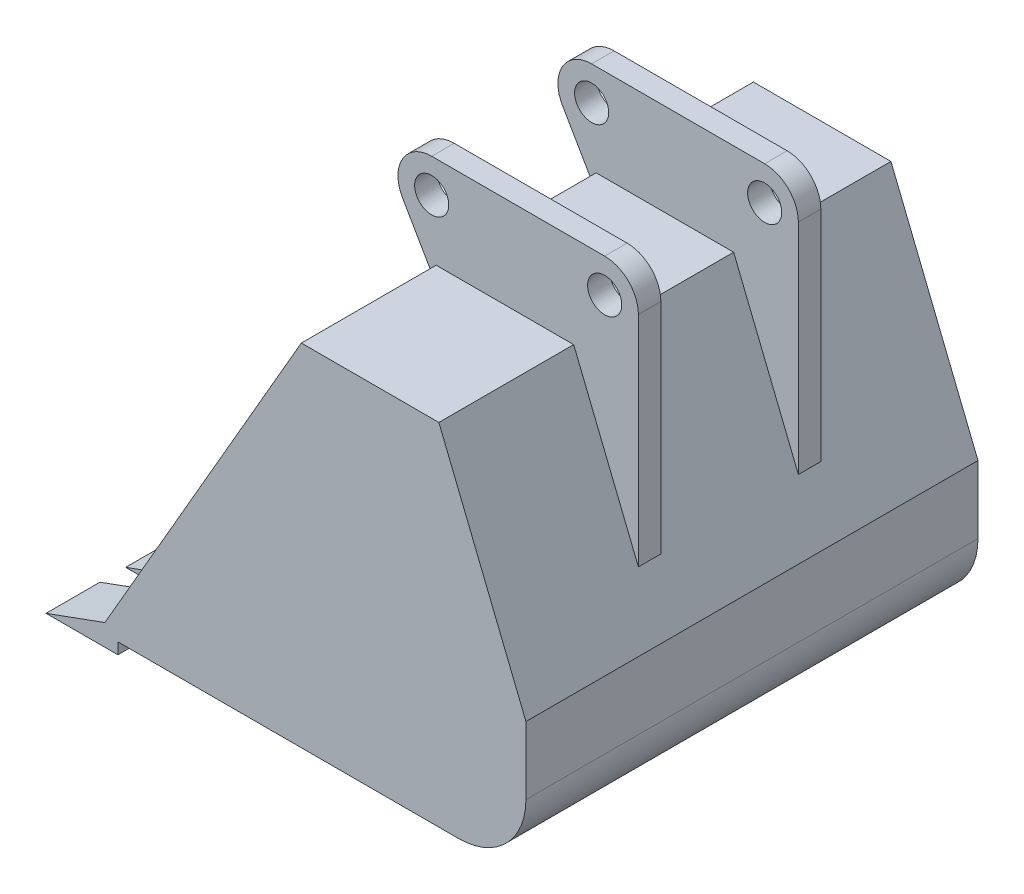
ISO-10303-21;
HEADER;
FILE_DESCRIPTION(('STEP AP214'),'2;1');
FILE_NAME('part.step','',(''),(''),'','','');
FILE_SCHEMA(('AUTOMOTIVE_DESIGN { 1 0 10303 214 1 1 1 1 }'));
ENDSEC;
DATA;
#1=APPLICATION_CONTEXT('core data for automotive mechanical design processes');
#2=APPLICATION_PROTOCOL_DEFINITION('international standard','automotive_design',2000,#1);
#3=PRODUCT_CONTEXT('',#1,'mechanical');
#4=PRODUCT('Part','Part','',(#3));
#5=PRODUCT_RELATED_PRODUCT_CATEGORY('part','',(#4));
#6=PRODUCT_DEFINITION_FORMATION('','',#4);
#7=PRODUCT_DEFINITION_CONTEXT('part definition',#1,'design');
#8=PRODUCT_DEFINITION('design','',#6,#7);
#9=PRODUCT_DEFINITION_SHAPE('','',#8);
#10=(LENGTH_UNIT() NAMED_UNIT(*) SI_UNIT(.MILLI.,.METRE.));
#11=(NAMED_UNIT(*) PLANE_ANGLE_UNIT() SI_UNIT($,.RADIAN.));
#12=(NAMED_UNIT(*) SI_UNIT($,.STERADIAN.) SOLID_ANGLE_UNIT());
#13=UNCERTAINTY_MEASURE_WITH_UNIT(LENGTH_MEASURE(1.E-05),#10,'distance_accuracy_value','');
#14=(GEOMETRIC_REPRESENTATION_CONTEXT(3) GLOBAL_UNCERTAINTY_ASSIGNED_CONTEXT((#13)) GLOBAL_UNIT_ASSIGNED_CONTEXT((#10,
#11,#12)) REPRESENTATION_CONTEXT('',''));
#15=CARTESIAN_POINT('',(0.,0.,0.));
#16=DIRECTION('',(0.,0.,1.));
#17=DIRECTION('',(1.,0.,0.));
#18=AXIS2_PLACEMENT_3D('',#15,#16,#17);
#19=CARTESIAN_POINT('',(-918.,-175.,503.));
#20=DIRECTION('',(0.342020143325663,-0.93969262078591,0.));
#21=DIRECTION('',(0.939692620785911,0.342020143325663,0.));
#22=AXIS2_PLACEMENT_3D('',#19,#20,#21);
#23=PLANE('',#22);
#24=DIRECTION('',(0.,0.,-1.));
#25=VECTOR('',#24,1.);
#26=CARTESIAN_POINT('',(-786.999555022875,-127.3197373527,503.));
#27=LINE('',#26,#25);
#28=CARTESIAN_POINT('',(-786.999555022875,-127.3197373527,-205.8));
#29=VERTEX_POINT('',#28);
#30=CARTESIAN_POINT('',(-786.999555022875,-127.3197373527,-325.8));
#31=VERTEX_POINT('',#30);
#32=EDGE_CURVE('E813',#29,#31,#27,.T.);
#33=ORIENTED_EDGE('',*,*,#32,.T.);
#34=DIRECTION('',(-0.939692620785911,-0.342020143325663,0.));
#35=VECTOR('',#34,1.);
#36=CARTESIAN_POINT('',(-918.,-175.,-325.8));
#37=LINE('',#36,#35);
#38=CARTESIAN_POINT('',(-918.,-175.,-325.8));
#39=VERTEX_POINT('',#38);
#40=EDGE_CURVE('E446',#31,#39,#37,.T.);
#41=ORIENTED_EDGE('',*,*,#40,.T.);
#42=DIRECTION('',(0.,0.,-1.));
#43=VECTOR('',#42,1.);
#44=CARTESIAN_POINT('',(-918.,-175.,503.));
#45=LINE('',#44,#43);
#46=CARTESIAN_POINT('',(-918.,-175.,-205.8));
#47=VERTEX_POINT('',#46);
#48=EDGE_CURVE('E1306',#47,#39,#45,.T.);
#49=ORIENTED_EDGE('',*,*,#48,.F.);
#50=DIRECTION('',(0.939692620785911,0.342020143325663,0.));
#51=VECTOR('',#50,1.);
#52=CARTESIAN_POINT('',(-918.,-175.,-205.8));
#53=LINE('',#52,#51);
#54=EDGE_CURVE('E442',#47,#29,#53,.T.);
#55=ORIENTED_EDGE('',*,*,#54,.T.);
#56=EDGE_LOOP('',(#33,#41,#49,#55));
#57=FACE_BOUND('',#56,.T.);
#58=ADVANCED_FACE('F33',(#57),#23,.F.);
#59=CARTESIAN_POINT('',(-918.,-175.,-383.));
#60=VERTEX_POINT('',#59);
#61=CARTESIAN_POINT('',(-918.,-175.,-503.));
#62=VERTEX_POINT('',#61);
#63=EDGE_CURVE('E687',#60,#62,#45,.T.);
#64=ORIENTED_EDGE('',*,*,#63,.F.);
#65=DIRECTION('',(0.939692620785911,0.342020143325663,0.));
#66=VECTOR('',#65,1.);
#67=CARTESIAN_POINT('',(-918.,-175.,-383.));
#68=LINE('',#67,#66);
#69=CARTESIAN_POINT('',(-786.999555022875,-127.3197373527,-383.));
#70=VERTEX_POINT('',#69);
#71=EDGE_CURVE('E345',#60,#70,#68,.T.);
#72=ORIENTED_EDGE('',*,*,#71,.T.);
#73=CARTESIAN_POINT('',(-786.999555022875,-127.3197373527,-503.));
#74=VERTEX_POINT('',#73);
#75=EDGE_CURVE('E691',#70,#74,#27,.T.);
#76=ORIENTED_EDGE('',*,*,#75,.T.);
#77=DIRECTION('',(-0.93969262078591,-0.342020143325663,0.));
#78=VECTOR('',#77,1.);
#79=CARTESIAN_POINT('',(-918.,-175.,-503.));
#80=LINE('',#79,#78);
#81=EDGE_CURVE('E671',#74,#62,#80,.T.);
#82=ORIENTED_EDGE('',*,*,#81,.T.);
#83=EDGE_LOOP('',(#64,#72,#76,#82));
#84=FACE_BOUND('',#83,.T.);
#85=ADVANCED_FACE('F773',(#84),#23,.F.);
#86=CARTESIAN_POINT('',(-786.999555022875,-127.3197373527,-28.6));
#87=VERTEX_POINT('',#86);
#88=CARTESIAN_POINT('',(-786.999555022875,-127.3197373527,-148.6));
#89=VERTEX_POINT('',#88);
#90=EDGE_CURVE('E810',#87,#89,#27,.T.);
#91=ORIENTED_EDGE('',*,*,#90,.T.);
#92=DIRECTION('',(-0.939692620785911,-0.342020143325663,0.));
#93=VECTOR('',#92,1.);
#94=CARTESIAN_POINT('',(-918.,-175.,-148.6));
#95=LINE('',#94,#93);
#96=CARTESIAN_POINT('',(-918.,-175.,-148.6));
#97=VERTEX_POINT('',#96);
#98=EDGE_CURVE('E436',#89,#97,#95,.T.);
#99=ORIENTED_EDGE('',*,*,#98,.T.);
#100=CARTESIAN_POINT('',(-918.,-175.,-28.6));
#101=VERTEX_POINT('',#100);
#102=EDGE_CURVE('E1307',#101,#97,#45,.T.);
#103=ORIENTED_EDGE('',*,*,#102,.F.);
#104=DIRECTION('',(0.939692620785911,0.342020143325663,0.));
#105=VECTOR('',#104,1.);
#106=CARTESIAN_POINT('',(-918.,-175.,-28.6000000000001));
#107=LINE('',#106,#105);
#108=EDGE_CURVE('E433',#101,#87,#107,.T.);
#109=ORIENTED_EDGE('',*,*,#108,.T.);
#110=EDGE_LOOP('',(#91,#99,#103,#109));
#111=FACE_BOUND('',#110,.T.);
#112=ADVANCED_FACE('F780',(#111),#23,.F.);
#113=CARTESIAN_POINT('',(-786.999555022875,-127.3197373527,148.6));
#114=VERTEX_POINT('',#113);
#115=CARTESIAN_POINT('',(-786.999555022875,-127.3197373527,28.6));
#116=VERTEX_POINT('',#115);
#117=EDGE_CURVE('E808',#114,#116,#27,.T.);
#118=ORIENTED_EDGE('',*,*,#117,.T.);
#119=DIRECTION('',(-0.939692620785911,-0.342020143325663,0.));
#120=VECTOR('',#119,1.);
#121=CARTESIAN_POINT('',(-918.,-175.,28.6));
#122=LINE('',#121,#120);
#123=CARTESIAN_POINT('',(-918.,-175.,28.6));
#124=VERTEX_POINT('',#123);
#125=EDGE_CURVE('E427',#116,#124,#122,.T.);
#126=ORIENTED_EDGE('',*,*,#125,.T.);
#127=CARTESIAN_POINT('',(-918.,-175.,148.6));
#128=VERTEX_POINT('',#127);
#129=EDGE_CURVE('E1309',#128,#124,#45,.T.);
#130=ORIENTED_EDGE('',*,*,#129,.F.);
#131=DIRECTION('',(0.939692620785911,0.342020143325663,0.));
#132=VECTOR('',#131,1.);
#133=CARTESIAN_POINT('',(-918.,-175.,148.6));
#134=LINE('',#133,#132);
#135=EDGE_CURVE('E424',#128,#114,#134,.T.);
#136=ORIENTED_EDGE('',*,*,#135,.T.);
#137=EDGE_LOOP('',(#118,#126,#130,#136));
#138=FACE_BOUND('',#137,.T.);
#139=ADVANCED_FACE('F797',(#138),#23,.F.);
#140=CARTESIAN_POINT('',(-786.999555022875,-127.3197373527,325.8));
#141=VERTEX_POINT('',#140);
#142=CARTESIAN_POINT('',(-786.999555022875,-127.3197373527,205.8));
#143=VERTEX_POINT('',#142);
#144=EDGE_CURVE('E697',#141,#143,#27,.T.);
#145=ORIENTED_EDGE('',*,*,#144,.T.);
#146=DIRECTION('',(-0.939692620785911,-0.342020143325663,0.));
#147=VECTOR('',#146,1.);
#148=CARTESIAN_POINT('',(-918.,-175.,205.8));
#149=LINE('',#148,#147);
#150=CARTESIAN_POINT('',(-918.,-175.,205.8));
#151=VERTEX_POINT('',#150);
#152=EDGE_CURVE('E418',#143,#151,#149,.T.);
#153=ORIENTED_EDGE('',*,*,#152,.T.);
#154=CARTESIAN_POINT('',(-918.,-175.,325.8));
#155=VERTEX_POINT('',#154);
#156=EDGE_CURVE('E692',#155,#151,#45,.T.);
#157=ORIENTED_EDGE('',*,*,#156,.F.);
#158=DIRECTION('',(0.939692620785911,0.342020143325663,0.));
#159=VECTOR('',#158,1.);
#160=CARTESIAN_POINT('',(-918.,-175.,325.8));
#161=LINE('',#160,#159);
#162=EDGE_CURVE('E415',#155,#141,#161,.T.);
#163=ORIENTED_EDGE('',*,*,#162,.T.);
#164=EDGE_LOOP('',(#145,#153,#157,#163));
#165=FACE_BOUND('',#164,.T.);
#166=ADVANCED_FACE('F788',(#165),#23,.F.);
#167=CARTESIAN_POINT('',(-349.760800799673,630.,503.));
#168=DIRECTION('',(0.,-1.,0.));
#169=DIRECTION('',(0.,0.,-1.));
#170=AXIS2_PLACEMENT_3D('',#167,#168,#169);
#171=PLANE('',#170);
#172=DIRECTION('',(1.,0.,0.));
#173=VECTOR('',#172,1.);
#174=CARTESIAN_POINT('',(-43.7608007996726,630.,-153.));
#175=LINE('',#174,#173);
#176=CARTESIAN_POINT('',(-349.760800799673,630.,-153.));
#177=VERTEX_POINT('',#176);
#178=CARTESIAN_POINT('',(-43.7608007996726,630.,-153.));
#179=VERTEX_POINT('',#178);
#180=EDGE_CURVE('E488',#177,#179,#175,.T.);
#181=ORIENTED_EDGE('',*,*,#180,.F.);
#182=DIRECTION('',(0.,0.,-1.));
#183=VECTOR('',#182,1.);
#184=CARTESIAN_POINT('',(-349.760800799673,630.,503.));
#185=LINE('',#184,#183);
#186=CARTESIAN_POINT('',(-349.760800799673,630.,153.));
#187=VERTEX_POINT('',#186);
#188=EDGE_CURVE('E702',#187,#177,#185,.T.);
#189=ORIENTED_EDGE('',*,*,#188,.F.);
#190=DIRECTION('',(1.,0.,0.));
#191=VECTOR('',#190,1.);
#192=CARTESIAN_POINT('',(-43.7608007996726,630.,153.));
#193=LINE('',#192,#191);
#194=CARTESIAN_POINT('',(-43.7608007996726,630.,153.));
#195=VERTEX_POINT('',#194);
#196=EDGE_CURVE('E537',#187,#195,#193,.T.);
#197=ORIENTED_EDGE('',*,*,#196,.T.);
#198=DIRECTION('',(0.,0.,-1.));
#199=VECTOR('',#198,1.);
#200=CARTESIAN_POINT('',(-43.7608007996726,630.,503.));
#201=LINE('',#200,#199);
#202=EDGE_CURVE('E705',#195,#179,#201,.T.);
#203=ORIENTED_EDGE('',*,*,#202,.T.);
#204=EDGE_LOOP('',(#181,#189,#197,#203));
#205=FACE_BOUND('',#204,.T.);
#206=ADVANCED_FACE('F729',(#205),#171,.F.);
#207=CARTESIAN_POINT('',(-349.760800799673,630.,-203.));
#208=VERTEX_POINT('',#207);
#209=CARTESIAN_POINT('',(-349.760800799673,630.,-503.));
#210=VERTEX_POINT('',#209);
#211=EDGE_CURVE('E696',#208,#210,#185,.T.);
#212=ORIENTED_EDGE('',*,*,#211,.F.);
#213=DIRECTION('',(1.,0.,0.));
#214=VECTOR('',#213,1.);
#215=CARTESIAN_POINT('',(-43.7608007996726,630.,-203.));
#216=LINE('',#215,#214);
#217=CARTESIAN_POINT('',(-43.7608007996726,630.,-203.));
#218=VERTEX_POINT('',#217);
#219=EDGE_CURVE('E465',#208,#218,#216,.T.);
#220=ORIENTED_EDGE('',*,*,#219,.T.);
#221=CARTESIAN_POINT('',(-43.7608007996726,630.,-503.));
#222=VERTEX_POINT('',#221);
#223=EDGE_CURVE('E701',#218,#222,#201,.T.);
#224=ORIENTED_EDGE('',*,*,#223,.T.);
#225=DIRECTION('',(-1.,0.,0.));
#226=VECTOR('',#225,1.);
#227=CARTESIAN_POINT('',(-349.760800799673,630.,-503.));
#228=LINE('',#227,#226);
#229=EDGE_CURVE('E665',#222,#210,#228,.T.);
#230=ORIENTED_EDGE('',*,*,#229,.T.);
#231=EDGE_LOOP('',(#212,#220,#224,#230));
#232=FACE_BOUND('',#231,.T.);
#233=ADVANCED_FACE('F723',(#232),#171,.F.);
#234=CARTESIAN_POINT('',(-786.999555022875,-127.3197373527,503.));
#235=DIRECTION('',(0.866025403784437,-0.500000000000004,0.));
#236=DIRECTION('',(0.500000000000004,0.866025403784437,0.));
#237=AXIS2_PLACEMENT_3D('',#234,#235,#236);
#238=PLANE('',#237);
#239=DIRECTION('',(0.,0.,1.));
#240=VECTOR('',#239,1.);
#241=CARTESIAN_POINT('',(-360.534303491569,611.339745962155,-203.));
#242=LINE('',#241,#240);
#243=CARTESIAN_POINT('',(-360.534303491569,611.339745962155,-203.));
#244=VERTEX_POINT('',#243);
#245=CARTESIAN_POINT('',(-360.534303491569,611.339745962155,-153.));
#246=VERTEX_POINT('',#245);
#247=EDGE_CURVE('E517',#244,#246,#242,.T.);
#248=ORIENTED_EDGE('',*,*,#247,.F.);
#249=DIRECTION('',(0.500000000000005,0.866025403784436,0.));
#250=VECTOR('',#249,1.);
#251=CARTESIAN_POINT('',(-349.760800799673,630.,-203.));
#252=LINE('',#251,#250);
#253=EDGE_CURVE('E468',#244,#208,#252,.T.);
#254=ORIENTED_EDGE('',*,*,#253,.T.);
#255=ORIENTED_EDGE('',*,*,#211,.T.);
#256=DIRECTION('',(-0.500000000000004,-0.866025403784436,0.));
#257=VECTOR('',#256,1.);
#258=CARTESIAN_POINT('',(-786.999555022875,-127.3197373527,-503.));
#259=LINE('',#258,#257);
#260=EDGE_CURVE('E668',#210,#74,#259,.T.);
#261=ORIENTED_EDGE('',*,*,#260,.T.);
#262=ORIENTED_EDGE('',*,*,#75,.F.);
#263=DIRECTION('',(0.,0.,1.));
#264=VECTOR('',#263,1.);
#265=CARTESIAN_POINT('',(-786.999555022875,-127.3197373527,503.));
#266=LINE('',#265,#264);
#267=EDGE_CURVE('E336',#70,#31,#266,.T.);
#268=ORIENTED_EDGE('',*,*,#267,.T.);
#269=ORIENTED_EDGE('',*,*,#32,.F.);
#270=DIRECTION('',(0.,0.,1.));
#271=VECTOR('',#270,1.);
#272=CARTESIAN_POINT('',(-786.999555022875,-127.3197373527,503.));
#273=LINE('',#272,#271);
#274=EDGE_CURVE('E439',#29,#89,#273,.T.);
#275=ORIENTED_EDGE('',*,*,#274,.T.);
#276=ORIENTED_EDGE('',*,*,#90,.F.);
#277=DIRECTION('',(0.,0.,1.));
#278=VECTOR('',#277,1.);
#279=CARTESIAN_POINT('',(-786.999555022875,-127.3197373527,503.));
#280=LINE('',#279,#278);
#281=EDGE_CURVE('E430',#87,#116,#280,.T.);
#282=ORIENTED_EDGE('',*,*,#281,.T.);
#283=ORIENTED_EDGE('',*,*,#117,.F.);
#284=DIRECTION('',(0.,0.,1.));
#285=VECTOR('',#284,1.);
#286=CARTESIAN_POINT('',(-786.999555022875,-127.3197373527,503.));
#287=LINE('',#286,#285);
#288=EDGE_CURVE('E421',#114,#143,#287,.T.);
#289=ORIENTED_EDGE('',*,*,#288,.T.);
#290=ORIENTED_EDGE('',*,*,#144,.F.);
#291=DIRECTION('',(0.,0.,1.));
#292=VECTOR('',#291,1.);
#293=CARTESIAN_POINT('',(-786.999555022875,-127.3197373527,503.));
#294=LINE('',#293,#292);
#295=CARTESIAN_POINT('',(-786.999555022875,-127.3197373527,383.));
#296=VERTEX_POINT('',#295);
#297=EDGE_CURVE('E412',#141,#296,#294,.T.);
#298=ORIENTED_EDGE('',*,*,#297,.T.);
#299=CARTESIAN_POINT('',(-786.999555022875,-127.3197373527,503.));
#300=VERTEX_POINT('',#299);
#301=EDGE_CURVE('E693',#300,#296,#27,.T.);
#302=ORIENTED_EDGE('',*,*,#301,.F.);
#303=DIRECTION('',(-0.500000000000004,-0.866025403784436,0.));
#304=VECTOR('',#303,1.);
#305=CARTESIAN_POINT('',(-786.999555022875,-127.3197373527,503.));
#306=LINE('',#305,#304);
#307=CARTESIAN_POINT('',(-349.760800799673,630.,503.));
#308=VERTEX_POINT('',#307);
#309=EDGE_CURVE('E647',#308,#300,#306,.T.);
#310=ORIENTED_EDGE('',*,*,#309,.F.);
#311=CARTESIAN_POINT('',(-349.760800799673,630.,203.));
#312=VERTEX_POINT('',#311);
#313=EDGE_CURVE('E698',#308,#312,#185,.T.);
#314=ORIENTED_EDGE('',*,*,#313,.T.);
#315=DIRECTION('',(0.500000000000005,0.866025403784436,0.));
#316=VECTOR('',#315,1.);
#317=CARTESIAN_POINT('',(-349.760800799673,630.,203.));
#318=LINE('',#317,#316);
#319=CARTESIAN_POINT('',(-360.534303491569,611.339745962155,203.));
#320=VERTEX_POINT('',#319);
#321=EDGE_CURVE('E548',#320,#312,#318,.T.);
#322=ORIENTED_EDGE('',*,*,#321,.F.);
#323=DIRECTION('',(0.,0.,-1.));
#324=VECTOR('',#323,1.);
#325=CARTESIAN_POINT('',(-360.534303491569,611.339745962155,203.));
#326=LINE('',#325,#324);
#327=CARTESIAN_POINT('',(-360.534303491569,611.339745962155,153.));
#328=VERTEX_POINT('',#327);
#329=EDGE_CURVE('E554',#320,#328,#326,.T.);
#330=ORIENTED_EDGE('',*,*,#329,.T.);
#331=DIRECTION('',(0.500000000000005,0.866025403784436,0.));
#332=VECTOR('',#331,1.);
#333=CARTESIAN_POINT('',(-349.760800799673,630.,153.));
#334=LINE('',#333,#332);
#335=EDGE_CURVE('E567',#328,#187,#334,.T.);
#336=ORIENTED_EDGE('',*,*,#335,.T.);
#337=ORIENTED_EDGE('',*,*,#188,.T.);
#338=DIRECTION('',(0.500000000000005,0.866025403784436,0.));
#339=VECTOR('',#338,1.);
#340=CARTESIAN_POINT('',(-349.760800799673,630.,-153.));
#341=LINE('',#340,#339);
#342=EDGE_CURVE('E491',#246,#177,#341,.T.);
#343=ORIENTED_EDGE('',*,*,#342,.F.);
#344=EDGE_LOOP('',(#248,#254,#255,#261,#262,#268,#269,#275,#276,#282,#283,#289,#290,#298,#302,
#310,#314,#322,#330,#336,#337,#343));
#345=FACE_BOUND('',#344,.T.);
#346=DIRECTION('',(-0.500000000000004,-0.866025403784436,0.));
#347=VECTOR('',#346,1.);
#348=CARTESIAN_POINT('',(-372.854811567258,590.,-463.));
#349=LINE('',#348,#347);
#350=CARTESIAN_POINT('',(-372.854811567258,590.,-463.));
#351=VERTEX_POINT('',#350);
#352=CARTESIAN_POINT('',(-777.,-110.,-463.));
#353=VERTEX_POINT('',#352);
#354=EDGE_CURVE('E604',#351,#353,#349,.T.);
#355=ORIENTED_EDGE('',*,*,#354,.F.);
#356=DIRECTION('',(0.,0.,1.));
#357=VECTOR('',#356,1.);
#358=CARTESIAN_POINT('',(-372.854811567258,590.,-463.));
#359=LINE('',#358,#357);
#360=CARTESIAN_POINT('',(-372.854811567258,590.,463.));
#361=VERTEX_POINT('',#360);
#362=EDGE_CURVE('E627',#351,#361,#359,.T.);
#363=ORIENTED_EDGE('',*,*,#362,.T.);
#364=DIRECTION('',(-0.500000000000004,-0.866025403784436,0.));
#365=VECTOR('',#364,1.);
#366=CARTESIAN_POINT('',(-372.854811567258,590.,463.));
#367=LINE('',#366,#365);
#368=CARTESIAN_POINT('',(-777.,-110.,463.));
#369=VERTEX_POINT('',#368);
#370=EDGE_CURVE('E592',#361,#369,#367,.T.);
#371=ORIENTED_EDGE('',*,*,#370,.T.);
#372=DIRECTION('',(0.,0.,1.));
#373=VECTOR('',#372,1.);
#374=CARTESIAN_POINT('',(-777.,-110.,-463.));
#375=LINE('',#374,#373);
#376=EDGE_CURVE('E623',#353,#369,#375,.T.);
#377=ORIENTED_EDGE('',*,*,#376,.F.);
#378=EDGE_LOOP('',(#355,#363,#371,#377));
#379=FACE_BOUND('',#378,.T.);
#380=ADVANCED_FACE('F738',(#345,#379),#238,.F.);
#381=CARTESIAN_POINT('',(0.,0.,503.));
#382=DIRECTION('',(0.,0.,-1.));
#383=DIRECTION('',(-1.,0.,0.));
#384=AXIS2_PLACEMENT_3D('',#381,#382,#383);
#385=CYLINDRICAL_SURFACE('',#384,150.);
#386=CARTESIAN_POINT('',(0.,0.,-503.));
#387=DIRECTION('',(0.,0.,1.));
#388=DIRECTION('',(1.,0.,0.));
#389=AXIS2_PLACEMENT_3D('',#386,#387,#388);
#390=CIRCLE('',#389,150.);
#391=CARTESIAN_POINT('',(0.,-150.,-503.));
#392=VERTEX_POINT('',#391);
#393=CARTESIAN_POINT('',(150.,0.,-503.));
#394=VERTEX_POINT('',#393);
#395=EDGE_CURVE('E626',#392,#394,#390,.T.);
#396=ORIENTED_EDGE('',*,*,#395,.T.);
#397=DIRECTION('',(0.,0.,-1.));
#398=VECTOR('',#397,1.);
#399=CARTESIAN_POINT('',(150.,0.,503.));
#400=LINE('',#399,#398);
#401=CARTESIAN_POINT('',(150.,0.,503.));
#402=VERTEX_POINT('',#401);
#403=EDGE_CURVE('E11',#402,#394,#400,.T.);
#404=ORIENTED_EDGE('',*,*,#403,.F.);
#405=CARTESIAN_POINT('',(0.,0.,503.));
#406=DIRECTION('',(0.,0.,1.));
#407=DIRECTION('',(1.,0.,0.));
#408=AXIS2_PLACEMENT_3D('',#405,#406,#407);
#409=CIRCLE('',#408,150.);
#410=CARTESIAN_POINT('',(0.,-150.,503.));
#411=VERTEX_POINT('',#410);
#412=EDGE_CURVE('E637',#411,#402,#409,.T.);
#413=ORIENTED_EDGE('',*,*,#412,.F.);
#414=DIRECTION('',(0.,0.,-1.));
#415=VECTOR('',#414,1.);
#416=CARTESIAN_POINT('',(0.,-150.,503.));
#417=LINE('',#416,#415);
#418=EDGE_CURVE('E657',#411,#392,#417,.T.);
#419=ORIENTED_EDGE('',*,*,#418,.T.);
#420=EDGE_LOOP('',(#396,#404,#413,#419));
#421=FACE_BOUND('',#420,.T.);
#422=ADVANCED_FACE('F35',(#421),#385,.T.);
#423=CARTESIAN_POINT('',(150.,150.425189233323,503.));
#424=DIRECTION('',(-1.,0.,0.));
#425=DIRECTION('',(0.,-1.,0.));
#426=AXIS2_PLACEMENT_3D('',#423,#424,#425);
#427=PLANE('',#426);
#428=DIRECTION('',(0.,1.,0.));
#429=VECTOR('',#428,1.);
#430=CARTESIAN_POINT('',(150.,150.425189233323,-503.));
#431=LINE('',#430,#429);
#432=CARTESIAN_POINT('',(150.,150.425189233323,-503.));
#433=VERTEX_POINT('',#432);
#434=EDGE_CURVE('E660',#394,#433,#431,.T.);
#435=ORIENTED_EDGE('',*,*,#434,.T.);
#436=DIRECTION('',(0.,0.,-1.));
#437=VECTOR('',#436,1.);
#438=CARTESIAN_POINT('',(150.,150.425189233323,503.));
#439=LINE('',#438,#437);
#440=CARTESIAN_POINT('',(150.,150.425189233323,503.));
#441=VERTEX_POINT('',#440);
#442=EDGE_CURVE('E41',#441,#433,#439,.T.);
#443=ORIENTED_EDGE('',*,*,#442,.F.);
#444=DIRECTION('',(0.,1.,0.));
#445=VECTOR('',#444,1.);
#446=CARTESIAN_POINT('',(150.,150.425189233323,503.));
#447=LINE('',#446,#445);
#448=EDGE_CURVE('E640',#402,#441,#447,.T.);
#449=ORIENTED_EDGE('',*,*,#448,.F.);
#450=ORIENTED_EDGE('',*,*,#403,.T.);
#451=EDGE_LOOP('',(#435,#443,#449,#450));
#452=FACE_BOUND('',#451,.T.);
#453=ADVANCED_FACE('F1049',(#452),#427,.F.);
#454=CARTESIAN_POINT('',(-43.7608007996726,630.,503.));
#455=DIRECTION('',(-0.927183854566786,-0.374606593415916,0.));
#456=DIRECTION('',(0.374606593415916,-0.927183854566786,0.));
#457=AXIS2_PLACEMENT_3D('',#454,#455,#456);
#458=PLANE('',#457);
#459=ORIENTED_EDGE('',*,*,#223,.F.);
#460=DIRECTION('',(0.374606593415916,-0.927183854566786,0.));
#461=VECTOR('',#460,1.);
#462=CARTESIAN_POINT('',(100.239199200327,273.587493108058,-203.));
#463=LINE('',#462,#461);
#464=CARTESIAN_POINT('',(100.239199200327,273.587493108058,-203.));
#465=VERTEX_POINT('',#464);
#466=EDGE_CURVE('E463',#218,#465,#463,.T.);
#467=ORIENTED_EDGE('',*,*,#466,.T.);
#468=DIRECTION('',(0.,0.,1.));
#469=VECTOR('',#468,1.);
#470=CARTESIAN_POINT('',(100.239199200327,273.587493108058,-203.));
#471=LINE('',#470,#469);
#472=CARTESIAN_POINT('',(100.239199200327,273.587493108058,-153.));
#473=VERTEX_POINT('',#472);
#474=EDGE_CURVE('E485',#465,#473,#471,.T.);
#475=ORIENTED_EDGE('',*,*,#474,.T.);
#476=DIRECTION('',(0.374606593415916,-0.927183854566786,0.));
#477=VECTOR('',#476,1.);
#478=CARTESIAN_POINT('',(100.239199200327,273.587493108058,-153.));
#479=LINE('',#478,#477);
#480=EDGE_CURVE('E460',#179,#473,#479,.T.);
#481=ORIENTED_EDGE('',*,*,#480,.F.);
#482=ORIENTED_EDGE('',*,*,#202,.F.);
#483=DIRECTION('',(0.374606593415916,-0.927183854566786,0.));
#484=VECTOR('',#483,1.);
#485=CARTESIAN_POINT('',(100.239199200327,273.587493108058,153.));
#486=LINE('',#485,#484);
#487=CARTESIAN_POINT('',(100.239199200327,273.587493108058,153.));
#488=VERTEX_POINT('',#487);
#489=EDGE_CURVE('E530',#195,#488,#486,.T.);
#490=ORIENTED_EDGE('',*,*,#489,.T.);
#491=DIRECTION('',(0.,0.,-1.));
#492=VECTOR('',#491,1.);
#493=CARTESIAN_POINT('',(100.239199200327,273.587493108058,203.));
#494=LINE('',#493,#492);
#495=CARTESIAN_POINT('',(100.239199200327,273.587493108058,203.));
#496=VERTEX_POINT('',#495);
#497=EDGE_CURVE('E584',#496,#488,#494,.T.);
#498=ORIENTED_EDGE('',*,*,#497,.F.);
#499=DIRECTION('',(0.374606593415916,-0.927183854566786,0.));
#500=VECTOR('',#499,1.);
#501=CARTESIAN_POINT('',(100.239199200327,273.587493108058,203.));
#502=LINE('',#501,#500);
#503=CARTESIAN_POINT('',(-43.7608007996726,630.,203.));
#504=VERTEX_POINT('',#503);
#505=EDGE_CURVE('E533',#504,#496,#502,.T.);
#506=ORIENTED_EDGE('',*,*,#505,.F.);
#507=CARTESIAN_POINT('',(-43.7608007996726,630.,503.));
#508=VERTEX_POINT('',#507);
#509=EDGE_CURVE('E703',#508,#504,#201,.T.);
#510=ORIENTED_EDGE('',*,*,#509,.F.);
#511=DIRECTION('',(-0.374606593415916,0.927183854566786,0.));
#512=VECTOR('',#511,1.);
#513=CARTESIAN_POINT('',(-43.7608007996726,630.,503.));
#514=LINE('',#513,#512);
#515=EDGE_CURVE('E643',#441,#508,#514,.T.);
#516=ORIENTED_EDGE('',*,*,#515,.F.);
#517=ORIENTED_EDGE('',*,*,#442,.T.);
#518=DIRECTION('',(-0.374606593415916,0.927183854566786,0.));
#519=VECTOR('',#518,1.);
#520=CARTESIAN_POINT('',(-43.7608007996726,630.,-503.));
#521=LINE('',#520,#519);
#522=EDGE_CURVE('E662',#433,#222,#521,.T.);
#523=ORIENTED_EDGE('',*,*,#522,.T.);
#524=EDGE_LOOP('',(#459,#467,#475,#481,#482,#490,#498,#506,#510,#516,#517,#523));
#525=FACE_BOUND('',#524,.T.);
#526=ADVANCED_FACE('F712',(#525),#458,.F.);
#527=ORIENTED_EDGE('',*,*,#509,.T.);
#528=DIRECTION('',(1.,0.,0.));
#529=VECTOR('',#528,1.);
#530=CARTESIAN_POINT('',(-43.7608007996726,630.,203.));
#531=LINE('',#530,#529);
#532=EDGE_CURVE('E551',#312,#504,#531,.T.);
#533=ORIENTED_EDGE('',*,*,#532,.F.);
#534=ORIENTED_EDGE('',*,*,#313,.F.);
#535=DIRECTION('',(-1.,0.,0.));
#536=VECTOR('',#535,1.);
#537=CARTESIAN_POINT('',(-349.760800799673,630.,503.));
#538=LINE('',#537,#536);
#539=EDGE_CURVE('E645',#508,#308,#538,.T.);
#540=ORIENTED_EDGE('',*,*,#539,.F.);
#541=EDGE_LOOP('',(#527,#533,#534,#540));
#542=FACE_BOUND('',#541,.T.);
#543=ADVANCED_FACE('F786',(#542),#171,.F.);
#544=ORIENTED_EDGE('',*,*,#301,.T.);
#545=DIRECTION('',(-0.939692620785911,-0.342020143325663,0.));
#546=VECTOR('',#545,1.);
#547=CARTESIAN_POINT('',(-918.,-175.,383.));
#548=LINE('',#547,#546);
#549=CARTESIAN_POINT('',(-918.,-175.,383.));
#550=VERTEX_POINT('',#549);
#551=EDGE_CURVE('E358',#296,#550,#548,.T.);
#552=ORIENTED_EDGE('',*,*,#551,.T.);
#553=CARTESIAN_POINT('',(-918.,-175.,503.));
#554=VERTEX_POINT('',#553);
#555=EDGE_CURVE('E688',#554,#550,#45,.T.);
#556=ORIENTED_EDGE('',*,*,#555,.F.);
#557=DIRECTION('',(-0.93969262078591,-0.342020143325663,0.));
#558=VECTOR('',#557,1.);
#559=CARTESIAN_POINT('',(-918.,-175.,503.));
#560=LINE('',#559,#558);
#561=EDGE_CURVE('E649',#300,#554,#560,.T.);
#562=ORIENTED_EDGE('',*,*,#561,.F.);
#563=EDGE_LOOP('',(#544,#552,#556,#562));
#564=FACE_BOUND('',#563,.T.);
#565=ADVANCED_FACE('F776',(#564),#23,.F.);
#566=CARTESIAN_POINT('',(-758.,-175.,503.));
#567=DIRECTION('',(0.,1.,0.));
#568=DIRECTION('',(-1.,0.,0.));
#569=AXIS2_PLACEMENT_3D('',#566,#567,#568);
#570=PLANE('',#569);
#571=ORIENTED_EDGE('',*,*,#48,.T.);
#572=DIRECTION('',(1.,0.,0.));
#573=VECTOR('',#572,1.);
#574=CARTESIAN_POINT('',(-786.999555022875,-175.,-325.8));
#575=LINE('',#574,#573);
#576=CARTESIAN_POINT('',(-786.999555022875,-175.,-325.8));
#577=VERTEX_POINT('',#576);
#578=EDGE_CURVE('E340',#39,#577,#575,.T.);
#579=ORIENTED_EDGE('',*,*,#578,.T.);
#580=DIRECTION('',(0.,0.,-1.));
#581=VECTOR('',#580,1.);
#582=CARTESIAN_POINT('',(-786.999555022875,-175.,-383.));
#583=LINE('',#582,#581);
#584=CARTESIAN_POINT('',(-786.999555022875,-175.,-383.));
#585=VERTEX_POINT('',#584);
#586=EDGE_CURVE('E333',#577,#585,#583,.T.);
#587=ORIENTED_EDGE('',*,*,#586,.T.);
#588=DIRECTION('',(-1.,0.,0.));
#589=VECTOR('',#588,1.);
#590=CARTESIAN_POINT('',(-786.999555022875,-175.,-383.));
#591=LINE('',#590,#589);
#592=EDGE_CURVE('E343',#585,#60,#591,.T.);
#593=ORIENTED_EDGE('',*,*,#592,.T.);
#594=ORIENTED_EDGE('',*,*,#63,.T.);
#595=DIRECTION('',(1.,0.,0.));
#596=VECTOR('',#595,1.);
#597=CARTESIAN_POINT('',(-758.,-175.,-503.));
#598=LINE('',#597,#596);
#599=CARTESIAN_POINT('',(-758.,-175.,-503.));
#600=VERTEX_POINT('',#599);
#601=EDGE_CURVE('E674',#62,#600,#598,.T.);
#602=ORIENTED_EDGE('',*,*,#601,.T.);
#603=DIRECTION('',(0.,0.,-1.));
#604=VECTOR('',#603,1.);
#605=CARTESIAN_POINT('',(-758.,-175.,503.));
#606=LINE('',#605,#604);
#607=CARTESIAN_POINT('',(-758.,-175.,503.));
#608=VERTEX_POINT('',#607);
#609=EDGE_CURVE('E684',#608,#600,#606,.T.);
#610=ORIENTED_EDGE('',*,*,#609,.F.);
#611=DIRECTION('',(1.,0.,0.));
#612=VECTOR('',#611,1.);
#613=CARTESIAN_POINT('',(-758.,-175.,503.));
#614=LINE('',#613,#612);
#615=EDGE_CURVE('E651',#554,#608,#614,.T.);
#616=ORIENTED_EDGE('',*,*,#615,.F.);
#617=ORIENTED_EDGE('',*,*,#555,.T.);
#618=DIRECTION('',(1.,0.,0.));
#619=VECTOR('',#618,1.);
#620=CARTESIAN_POINT('',(-786.999555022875,-175.,383.));
#621=LINE('',#620,#619);
#622=CARTESIAN_POINT('',(-786.999555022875,-175.,383.));
#623=VERTEX_POINT('',#622);
#624=EDGE_CURVE('E399',#550,#623,#621,.T.);
#625=ORIENTED_EDGE('',*,*,#624,.T.);
#626=DIRECTION('',(0.,0.,-1.));
#627=VECTOR('',#626,1.);
#628=CARTESIAN_POINT('',(-786.999555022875,-175.,325.8));
#629=LINE('',#628,#627);
#630=CARTESIAN_POINT('',(-786.999555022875,-175.,325.8));
#631=VERTEX_POINT('',#630);
#632=EDGE_CURVE('E402',#623,#631,#629,.T.);
#633=ORIENTED_EDGE('',*,*,#632,.T.);
#634=DIRECTION('',(-1.,0.,0.));
#635=VECTOR('',#634,1.);
#636=CARTESIAN_POINT('',(-786.999555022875,-175.,325.8));
#637=LINE('',#636,#635);
#638=EDGE_CURVE('E396',#631,#155,#637,.T.);
#639=ORIENTED_EDGE('',*,*,#638,.T.);
#640=ORIENTED_EDGE('',*,*,#156,.T.);
#641=DIRECTION('',(1.,0.,0.));
#642=VECTOR('',#641,1.);
#643=CARTESIAN_POINT('',(-786.999555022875,-175.,205.8));
#644=LINE('',#643,#642);
#645=CARTESIAN_POINT('',(-786.999555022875,-175.,205.8));
#646=VERTEX_POINT('',#645);
#647=EDGE_CURVE('E384',#151,#646,#644,.T.);
#648=ORIENTED_EDGE('',*,*,#647,.T.);
#649=DIRECTION('',(0.,0.,-1.));
#650=VECTOR('',#649,1.);
#651=CARTESIAN_POINT('',(-786.999555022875,-175.,148.6));
#652=LINE('',#651,#650);
#653=CARTESIAN_POINT('',(-786.999555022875,-175.,148.6));
#654=VERTEX_POINT('',#653);
#655=EDGE_CURVE('E388',#646,#654,#652,.T.);
#656=ORIENTED_EDGE('',*,*,#655,.T.);
#657=DIRECTION('',(-1.,0.,0.));
#658=VECTOR('',#657,1.);
#659=CARTESIAN_POINT('',(-786.999555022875,-175.,148.6));
#660=LINE('',#659,#658);
#661=EDGE_CURVE('E381',#654,#128,#660,.T.);
#662=ORIENTED_EDGE('',*,*,#661,.T.);
#663=ORIENTED_EDGE('',*,*,#129,.T.);
#664=DIRECTION('',(1.,0.,0.));
#665=VECTOR('',#664,1.);
#666=CARTESIAN_POINT('',(-786.999555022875,-175.,28.6));
#667=LINE('',#666,#665);
#668=CARTESIAN_POINT('',(-786.999555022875,-175.,28.6));
#669=VERTEX_POINT('',#668);
#670=EDGE_CURVE('E372',#124,#669,#667,.T.);
#671=ORIENTED_EDGE('',*,*,#670,.T.);
#672=DIRECTION('',(0.,0.,-1.));
#673=VECTOR('',#672,1.);
#674=CARTESIAN_POINT('',(-786.999555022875,-175.,-28.6));
#675=LINE('',#674,#673);
#676=CARTESIAN_POINT('',(-786.999555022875,-175.,-28.6));
#677=VERTEX_POINT('',#676);
#678=EDGE_CURVE('E56',#669,#677,#675,.T.);
#679=ORIENTED_EDGE('',*,*,#678,.T.);
#680=DIRECTION('',(-1.,0.,0.));
#681=VECTOR('',#680,1.);
#682=CARTESIAN_POINT('',(-786.999555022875,-175.,-28.6));
#683=LINE('',#682,#681);
#684=EDGE_CURVE('E369',#677,#101,#683,.T.);
#685=ORIENTED_EDGE('',*,*,#684,.T.);
#686=ORIENTED_EDGE('',*,*,#102,.T.);
#687=DIRECTION('',(1.,0.,0.));
#688=VECTOR('',#687,1.);
#689=CARTESIAN_POINT('',(-786.999555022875,-175.,-148.6));
#690=LINE('',#689,#688);
#691=CARTESIAN_POINT('',(-786.999555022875,-175.,-148.6));
#692=VERTEX_POINT('',#691);
#693=EDGE_CURVE('E363',#97,#692,#690,.T.);
#694=ORIENTED_EDGE('',*,*,#693,.T.);
#695=DIRECTION('',(0.,0.,-1.));
#696=VECTOR('',#695,1.);
#697=CARTESIAN_POINT('',(-786.999555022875,-175.,-205.8));
#698=LINE('',#697,#696);
#699=CARTESIAN_POINT('',(-786.999555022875,-175.,-205.8));
#700=VERTEX_POINT('',#699);
#701=EDGE_CURVE('E48',#692,#700,#698,.T.);
#702=ORIENTED_EDGE('',*,*,#701,.T.);
#703=DIRECTION('',(-1.,0.,0.));
#704=VECTOR('',#703,1.);
#705=CARTESIAN_POINT('',(-786.999555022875,-175.,-205.8));
#706=LINE('',#705,#704);
#707=EDGE_CURVE('E360',#700,#47,#706,.T.);
#708=ORIENTED_EDGE('',*,*,#707,.T.);
#709=EDGE_LOOP('',(#571,#579,#587,#593,#594,#602,#610,#616,#617,#625,#633,#639,#640,#648,#656,
#662,#663,#671,#679,#685,#686,#694,#702,#708));
#710=FACE_BOUND('',#709,.T.);
#711=ADVANCED_FACE('F350',(#710),#570,.F.);
#712=CARTESIAN_POINT('',(-758.,-150.,503.));
#713=DIRECTION('',(-1.,0.,0.));
#714=DIRECTION('',(0.,0.,1.));
#715=AXIS2_PLACEMENT_3D('',#712,#713,#714);
#716=PLANE('',#715);
#717=DIRECTION('',(0.,1.,0.));
#718=VECTOR('',#717,1.);
#719=CARTESIAN_POINT('',(-758.,-150.,-503.));
#720=LINE('',#719,#718);
#721=CARTESIAN_POINT('',(-758.,-150.,-503.));
#722=VERTEX_POINT('',#721);
#723=EDGE_CURVE('E676',#600,#722,#720,.T.);
#724=ORIENTED_EDGE('',*,*,#723,.T.);
#725=DIRECTION('',(0.,0.,-1.));
#726=VECTOR('',#725,1.);
#727=CARTESIAN_POINT('',(-758.,-150.,503.));
#728=LINE('',#727,#726);
#729=CARTESIAN_POINT('',(-758.,-150.,503.));
#730=VERTEX_POINT('',#729);
#731=EDGE_CURVE('E681',#730,#722,#728,.T.);
#732=ORIENTED_EDGE('',*,*,#731,.F.);
#733=DIRECTION('',(0.,1.,0.));
#734=VECTOR('',#733,1.);
#735=CARTESIAN_POINT('',(-758.,-150.,503.));
#736=LINE('',#735,#734);
#737=EDGE_CURVE('E653',#608,#730,#736,.T.);
#738=ORIENTED_EDGE('',*,*,#737,.F.);
#739=ORIENTED_EDGE('',*,*,#609,.T.);
#740=EDGE_LOOP('',(#724,#732,#738,#739));
#741=FACE_BOUND('',#740,.T.);
#742=ADVANCED_FACE('F793',(#741),#716,.F.);
#743=CARTESIAN_POINT('',(0.,-150.,503.));
#744=DIRECTION('',(0.,1.,0.));
#745=DIRECTION('',(-1.,0.,0.));
#746=AXIS2_PLACEMENT_3D('',#743,#744,#745);
#747=PLANE('',#746);
#748=DIRECTION('',(1.,0.,0.));
#749=VECTOR('',#748,1.);
#750=CARTESIAN_POINT('',(0.,-150.,-503.));
#751=LINE('',#750,#749);
#752=EDGE_CURVE('E641',#722,#392,#751,.T.);
#753=ORIENTED_EDGE('',*,*,#752,.T.);
#754=ORIENTED_EDGE('',*,*,#418,.F.);
#755=DIRECTION('',(1.,0.,0.));
#756=VECTOR('',#755,1.);
#757=CARTESIAN_POINT('',(0.,-150.,503.));
#758=LINE('',#757,#756);
#759=EDGE_CURVE('E655',#730,#411,#758,.T.);
#760=ORIENTED_EDGE('',*,*,#759,.F.);
#761=ORIENTED_EDGE('',*,*,#731,.T.);
#762=EDGE_LOOP('',(#753,#754,#760,#761));
#763=FACE_BOUND('',#762,.T.);
#764=ADVANCED_FACE('F918',(#763),#747,.F.);
#765=CARTESIAN_POINT('',(0.,0.,503.));
#766=DIRECTION('',(0.,0.,1.));
#767=DIRECTION('',(1.,0.,0.));
#768=AXIS2_PLACEMENT_3D('',#765,#766,#767);
#769=PLANE('',#768);
#770=ORIENTED_EDGE('',*,*,#412,.T.);
#771=ORIENTED_EDGE('',*,*,#448,.T.);
#772=ORIENTED_EDGE('',*,*,#515,.T.);
#773=ORIENTED_EDGE('',*,*,#539,.T.);
#774=ORIENTED_EDGE('',*,*,#309,.T.);
#775=ORIENTED_EDGE('',*,*,#561,.T.);
#776=ORIENTED_EDGE('',*,*,#615,.T.);
#777=ORIENTED_EDGE('',*,*,#737,.T.);
#778=ORIENTED_EDGE('',*,*,#759,.T.);
#779=EDGE_LOOP('',(#770,#771,#772,#773,#774,#775,#776,#777,#778));
#780=FACE_BOUND('',#779,.T.);
#781=ADVANCED_FACE('F828',(#780),#769,.T.);
#782=CARTESIAN_POINT('',(0.,0.,-503.));
#783=DIRECTION('',(0.,0.,1.));
#784=DIRECTION('',(1.,0.,0.));
#785=AXIS2_PLACEMENT_3D('',#782,#783,#784);
#786=PLANE('',#785);
#787=ORIENTED_EDGE('',*,*,#395,.F.);
#788=ORIENTED_EDGE('',*,*,#752,.F.);
#789=ORIENTED_EDGE('',*,*,#723,.F.);
#790=ORIENTED_EDGE('',*,*,#601,.F.);
#791=ORIENTED_EDGE('',*,*,#81,.F.);
#792=ORIENTED_EDGE('',*,*,#260,.F.);
#793=ORIENTED_EDGE('',*,*,#229,.F.);
#794=ORIENTED_EDGE('',*,*,#522,.F.);
#795=ORIENTED_EDGE('',*,*,#434,.F.);
#796=EDGE_LOOP('',(#787,#788,#789,#790,#791,#792,#793,#794,#795));
#797=FACE_BOUND('',#796,.T.);
#798=ADVANCED_FACE('F718',(#797),#786,.F.);
#799=CARTESIAN_POINT('',(-777.,-110.,-463.));
#800=DIRECTION('',(0.,-1.,0.));
#801=DIRECTION('',(1.,0.,0.));
#802=AXIS2_PLACEMENT_3D('',#799,#800,#801);
#803=PLANE('',#802);
#804=DIRECTION('',(1.,0.,0.));
#805=VECTOR('',#804,1.);
#806=CARTESIAN_POINT('',(-777.,-110.,463.));
#807=LINE('',#806,#805);
#808=CARTESIAN_POINT('',(0.,-110.,463.));
#809=VERTEX_POINT('',#808);
#810=EDGE_CURVE('E587',#369,#809,#807,.T.);
#811=ORIENTED_EDGE('',*,*,#810,.T.);
#812=DIRECTION('',(0.,0.,1.));
#813=VECTOR('',#812,1.);
#814=CARTESIAN_POINT('',(0.,-110.,-463.));
#815=LINE('',#814,#813);
#816=CARTESIAN_POINT('',(0.,-110.,-463.));
#817=VERTEX_POINT('',#816);
#818=EDGE_CURVE('E607',#817,#809,#815,.T.);
#819=ORIENTED_EDGE('',*,*,#818,.F.);
#820=DIRECTION('',(1.,0.,0.));
#821=VECTOR('',#820,1.);
#822=CARTESIAN_POINT('',(-777.,-110.,-463.));
#823=LINE('',#822,#821);
#824=EDGE_CURVE('E588',#353,#817,#823,.T.);
#825=ORIENTED_EDGE('',*,*,#824,.F.);
#826=ORIENTED_EDGE('',*,*,#376,.T.);
#827=EDGE_LOOP('',(#811,#819,#825,#826));
#828=FACE_BOUND('',#827,.T.);
#829=ADVANCED_FACE('F901',(#828),#803,.F.);
#830=CARTESIAN_POINT('',(-70.7411414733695,590.,-463.));
#831=DIRECTION('',(0.,1.,0.));
#832=DIRECTION('',(-1.,0.,0.));
#833=AXIS2_PLACEMENT_3D('',#830,#831,#832);
#834=PLANE('',#833);
#835=DIRECTION('',(-1.,0.,0.));
#836=VECTOR('',#835,1.);
#837=CARTESIAN_POINT('',(-70.7411414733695,590.,463.));
#838=LINE('',#837,#836);
#839=CARTESIAN_POINT('',(-70.7411414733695,590.,463.));
#840=VERTEX_POINT('',#839);
#841=EDGE_CURVE('E619',#840,#361,#838,.T.);
#842=ORIENTED_EDGE('',*,*,#841,.T.);
#843=ORIENTED_EDGE('',*,*,#362,.F.);
#844=DIRECTION('',(-1.,0.,0.));
#845=VECTOR('',#844,1.);
#846=CARTESIAN_POINT('',(-70.7411414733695,590.,-463.));
#847=LINE('',#846,#845);
#848=CARTESIAN_POINT('',(-70.7411414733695,590.,-463.));
#849=VERTEX_POINT('',#848);
#850=EDGE_CURVE('E601',#849,#351,#847,.T.);
#851=ORIENTED_EDGE('',*,*,#850,.F.);
#852=DIRECTION('',(0.,0.,1.));
#853=VECTOR('',#852,1.);
#854=CARTESIAN_POINT('',(-70.7411414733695,590.,-463.));
#855=LINE('',#854,#853);
#856=EDGE_CURVE('E630',#849,#840,#855,.T.);
#857=ORIENTED_EDGE('',*,*,#856,.T.);
#858=EDGE_LOOP('',(#842,#843,#851,#857));
#859=FACE_BOUND('',#858,.T.);
#860=ADVANCED_FACE('F897',(#859),#834,.F.);
#861=CARTESIAN_POINT('',(110.,142.649976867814,-463.));
#862=DIRECTION('',(0.927183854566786,0.374606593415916,0.));
#863=DIRECTION('',(-0.374606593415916,0.927183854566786,0.));
#864=AXIS2_PLACEMENT_3D('',#861,#862,#863);
#865=PLANE('',#864);
#866=DIRECTION('',(-0.374606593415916,0.927183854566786,0.));
#867=VECTOR('',#866,1.);
#868=CARTESIAN_POINT('',(110.,142.649976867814,463.));
#869=LINE('',#868,#867);
#870=CARTESIAN_POINT('',(110.,142.649976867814,463.));
#871=VERTEX_POINT('',#870);
#872=EDGE_CURVE('E616',#871,#840,#869,.T.);
#873=ORIENTED_EDGE('',*,*,#872,.T.);
#874=ORIENTED_EDGE('',*,*,#856,.F.);
#875=DIRECTION('',(-0.374606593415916,0.927183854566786,0.));
#876=VECTOR('',#875,1.);
#877=CARTESIAN_POINT('',(110.,142.649976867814,-463.));
#878=LINE('',#877,#876);
#879=CARTESIAN_POINT('',(110.,142.649976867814,-463.));
#880=VERTEX_POINT('',#879);
#881=EDGE_CURVE('E598',#880,#849,#878,.T.);
#882=ORIENTED_EDGE('',*,*,#881,.F.);
#883=DIRECTION('',(0.,0.,1.));
#884=VECTOR('',#883,1.);
#885=CARTESIAN_POINT('',(110.,142.649976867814,-463.));
#886=LINE('',#885,#884);
#887=EDGE_CURVE('E632',#880,#871,#886,.T.);
#888=ORIENTED_EDGE('',*,*,#887,.T.);
#889=EDGE_LOOP('',(#873,#874,#882,#888));
#890=FACE_BOUND('',#889,.T.);
#891=ADVANCED_FACE('F900',(#890),#865,.F.);
#892=CARTESIAN_POINT('',(110.,0.,-463.));
#893=DIRECTION('',(1.,0.,0.));
#894=DIRECTION('',(0.,1.,0.));
#895=AXIS2_PLACEMENT_3D('',#892,#893,#894);
#896=PLANE('',#895);
#897=DIRECTION('',(0.,1.,0.));
#898=VECTOR('',#897,1.);
#899=CARTESIAN_POINT('',(110.,0.,463.));
#900=LINE('',#899,#898);
#901=CARTESIAN_POINT('',(110.,0.,463.));
#902=VERTEX_POINT('',#901);
#903=EDGE_CURVE('E613',#902,#871,#900,.T.);
#904=ORIENTED_EDGE('',*,*,#903,.T.);
#905=ORIENTED_EDGE('',*,*,#887,.F.);
#906=DIRECTION('',(0.,1.,0.));
#907=VECTOR('',#906,1.);
#908=CARTESIAN_POINT('',(110.,0.,-463.));
#909=LINE('',#908,#907);
#910=CARTESIAN_POINT('',(110.,0.,-463.));
#911=VERTEX_POINT('',#910);
#912=EDGE_CURVE('E595',#911,#880,#909,.T.);
#913=ORIENTED_EDGE('',*,*,#912,.F.);
#914=DIRECTION('',(0.,0.,1.));
#915=VECTOR('',#914,1.);
#916=CARTESIAN_POINT('',(110.,0.,-463.));
#917=LINE('',#916,#915);
#918=EDGE_CURVE('E634',#911,#902,#917,.T.);
#919=ORIENTED_EDGE('',*,*,#918,.T.);
#920=EDGE_LOOP('',(#904,#905,#913,#919));
#921=FACE_BOUND('',#920,.T.);
#922=ADVANCED_FACE('F905',(#921),#896,.F.);
#923=CARTESIAN_POINT('',(0.,0.,-463.));
#924=DIRECTION('',(0.,0.,1.));
#925=DIRECTION('',(1.,0.,0.));
#926=AXIS2_PLACEMENT_3D('',#923,#924,#925);
#927=CYLINDRICAL_SURFACE('',#926,110.);
#928=CARTESIAN_POINT('',(0.,0.,463.));
#929=DIRECTION('',(0.,0.,1.));
#930=DIRECTION('',(1.,0.,0.));
#931=AXIS2_PLACEMENT_3D('',#928,#929,#930);
#932=CIRCLE('',#931,110.);
#933=EDGE_CURVE('E610',#809,#902,#932,.T.);
#934=ORIENTED_EDGE('',*,*,#933,.T.);
#935=ORIENTED_EDGE('',*,*,#918,.F.);
#936=CARTESIAN_POINT('',(0.,0.,-463.));
#937=DIRECTION('',(0.,0.,1.));
#938=DIRECTION('',(1.,0.,0.));
#939=AXIS2_PLACEMENT_3D('',#936,#937,#938);
#940=CIRCLE('',#939,110.);
#941=EDGE_CURVE('E591',#817,#911,#940,.T.);
#942=ORIENTED_EDGE('',*,*,#941,.F.);
#943=ORIENTED_EDGE('',*,*,#818,.T.);
#944=EDGE_LOOP('',(#934,#935,#942,#943));
#945=FACE_BOUND('',#944,.T.);
#946=ADVANCED_FACE('F892',(#945),#927,.F.);
#947=CARTESIAN_POINT('',(0.,0.,-463.));
#948=DIRECTION('',(0.,0.,1.));
#949=DIRECTION('',(1.,0.,0.));
#950=AXIS2_PLACEMENT_3D('',#947,#948,#949);
#951=PLANE('',#950);
#952=ORIENTED_EDGE('',*,*,#824,.T.);
#953=ORIENTED_EDGE('',*,*,#941,.T.);
#954=ORIENTED_EDGE('',*,*,#912,.T.);
#955=ORIENTED_EDGE('',*,*,#881,.T.);
#956=ORIENTED_EDGE('',*,*,#850,.T.);
#957=ORIENTED_EDGE('',*,*,#354,.T.);
#958=EDGE_LOOP('',(#952,#953,#954,#955,#956,#957));
#959=FACE_BOUND('',#958,.T.);
#960=ADVANCED_FACE('F888',(#959),#951,.T.);
#961=CARTESIAN_POINT('',(0.,0.,463.));
#962=DIRECTION('',(0.,0.,1.));
#963=DIRECTION('',(1.,0.,0.));
#964=AXIS2_PLACEMENT_3D('',#961,#962,#963);
#965=PLANE('',#964);
#966=ORIENTED_EDGE('',*,*,#810,.F.);
#967=ORIENTED_EDGE('',*,*,#370,.F.);
#968=ORIENTED_EDGE('',*,*,#841,.F.);
#969=ORIENTED_EDGE('',*,*,#872,.F.);
#970=ORIENTED_EDGE('',*,*,#903,.F.);
#971=ORIENTED_EDGE('',*,*,#933,.F.);
#972=EDGE_LOOP('',(#966,#967,#968,#969,#970,#971));
#973=FACE_BOUND('',#972,.T.);
#974=ADVANCED_FACE('F891',(#973),#965,.F.);
#975=CARTESIAN_POINT('',(-359.760800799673,760.,203.));
#976=DIRECTION('',(0.,0.,1.));
#977=DIRECTION('',(1.,0.,0.));
#978=AXIS2_PLACEMENT_3D('',#975,#976,#977);
#979=PLANE('',#978);
#980=CARTESIAN_POINT('',(25.2391992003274,760.,203.));
#981=DIRECTION('',(0.,0.,1.));
#982=DIRECTION('',(1.,0.,0.));
#983=AXIS2_PLACEMENT_3D('',#980,#981,#982);
#984=CIRCLE('',#983,38.);
#985=CARTESIAN_POINT('',(63.2391992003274,760.,203.));
#986=VERTEX_POINT('',#985);
#987=EDGE_CURVE('E527',#986,#986,#984,.T.);
#988=ORIENTED_EDGE('',*,*,#987,.F.);
#989=EDGE_LOOP('',(#988));
#990=FACE_BOUND('',#989,.T.);
#991=ORIENTED_EDGE('',*,*,#505,.T.);
#992=DIRECTION('',(0.,1.,0.));
#993=VECTOR('',#992,1.);
#994=CARTESIAN_POINT('',(100.239199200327,273.587493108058,203.));
#995=LINE('',#994,#993);
#996=CARTESIAN_POINT('',(100.239199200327,760.,203.));
#997=VERTEX_POINT('',#996);
#998=EDGE_CURVE('E536',#496,#997,#995,.T.);
#999=ORIENTED_EDGE('',*,*,#998,.T.);
#1000=CARTESIAN_POINT('',(25.2391992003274,760.,203.));
#1001=DIRECTION('',(0.,0.,1.));
#1002=DIRECTION('',(1.,0.,0.));
#1003=AXIS2_PLACEMENT_3D('',#1000,#1001,#1002);
#1004=CIRCLE('',#1003,75.);
#1005=CARTESIAN_POINT('',(25.2391992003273,835.,203.));
#1006=VERTEX_POINT('',#1005);
#1007=EDGE_CURVE('E539',#997,#1006,#1004,.T.);
#1008=ORIENTED_EDGE('',*,*,#1007,.T.);
#1009=DIRECTION('',(-1.,0.,0.));
#1010=VECTOR('',#1009,1.);
#1011=CARTESIAN_POINT('',(25.2391992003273,835.,203.));
#1012=LINE('',#1011,#1010);
#1013=CARTESIAN_POINT('',(-359.760800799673,835.,203.));
#1014=VERTEX_POINT('',#1013);
#1015=EDGE_CURVE('E541',#1006,#1014,#1012,.T.);
#1016=ORIENTED_EDGE('',*,*,#1015,.T.);
#1017=CARTESIAN_POINT('',(-359.760800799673,760.,203.));
#1018=DIRECTION('',(0.,0.,1.));
#1019=DIRECTION('',(1.,0.,0.));
#1020=AXIS2_PLACEMENT_3D('',#1017,#1018,#1019);
#1021=CIRCLE('',#1020,75.0000000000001);
#1022=CARTESIAN_POINT('',(-424.712706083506,722.5,203.));
#1023=VERTEX_POINT('',#1022);
#1024=EDGE_CURVE('E543',#1014,#1023,#1021,.T.);
#1025=ORIENTED_EDGE('',*,*,#1024,.T.);
#1026=DIRECTION('',(0.499999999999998,-0.86602540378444,0.));
#1027=VECTOR('',#1026,1.);
#1028=CARTESIAN_POINT('',(-424.712706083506,722.5,203.));
#1029=LINE('',#1028,#1027);
#1030=EDGE_CURVE('E545',#1023,#320,#1029,.T.);
#1031=ORIENTED_EDGE('',*,*,#1030,.T.);
#1032=ORIENTED_EDGE('',*,*,#321,.T.);
#1033=ORIENTED_EDGE('',*,*,#532,.T.);
#1034=EDGE_LOOP('',(#991,#999,#1008,#1016,#1025,#1031,#1032,#1033));
#1035=FACE_BOUND('',#1034,.T.);
#1036=CARTESIAN_POINT('',(-359.760800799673,760.,203.));
#1037=DIRECTION('',(0.,0.,1.));
#1038=DIRECTION('',(1.,0.,0.));
#1039=AXIS2_PLACEMENT_3D('',#1036,#1037,#1038);
#1040=CIRCLE('',#1039,38.);
#1041=CARTESIAN_POINT('',(-321.760800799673,760.,203.));
#1042=VERTEX_POINT('',#1041);
#1043=EDGE_CURVE('E521',#1042,#1042,#1040,.T.);
#1044=ORIENTED_EDGE('',*,*,#1043,.F.);
#1045=EDGE_LOOP('',(#1044));
#1046=FACE_BOUND('',#1045,.T.);
#1047=ADVANCED_FACE('F842',(#990,#1035,#1046),#979,.T.);
#1048=CARTESIAN_POINT('',(-359.760800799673,760.,153.));
#1049=DIRECTION('',(0.,0.,1.));
#1050=DIRECTION('',(1.,0.,0.));
#1051=AXIS2_PLACEMENT_3D('',#1048,#1049,#1050);
#1052=PLANE('',#1051);
#1053=ORIENTED_EDGE('',*,*,#489,.F.);
#1054=ORIENTED_EDGE('',*,*,#196,.F.);
#1055=ORIENTED_EDGE('',*,*,#335,.F.);
#1056=DIRECTION('',(0.499999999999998,-0.86602540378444,0.));
#1057=VECTOR('',#1056,1.);
#1058=CARTESIAN_POINT('',(-424.712706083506,722.5,153.));
#1059=LINE('',#1058,#1057);
#1060=CARTESIAN_POINT('',(-424.712706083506,722.5,153.));
#1061=VERTEX_POINT('',#1060);
#1062=EDGE_CURVE('E564',#1061,#328,#1059,.T.);
#1063=ORIENTED_EDGE('',*,*,#1062,.F.);
#1064=CARTESIAN_POINT('',(-359.760800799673,760.,153.));
#1065=DIRECTION('',(0.,0.,1.));
#1066=DIRECTION('',(1.,0.,0.));
#1067=AXIS2_PLACEMENT_3D('',#1064,#1065,#1066);
#1068=CIRCLE('',#1067,75.0000000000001);
#1069=CARTESIAN_POINT('',(-359.760800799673,835.,153.));
#1070=VERTEX_POINT('',#1069);
#1071=EDGE_CURVE('E562',#1070,#1061,#1068,.T.);
#1072=ORIENTED_EDGE('',*,*,#1071,.F.);
#1073=DIRECTION('',(-1.,0.,0.));
#1074=VECTOR('',#1073,1.);
#1075=CARTESIAN_POINT('',(25.2391992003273,835.,153.));
#1076=LINE('',#1075,#1074);
#1077=CARTESIAN_POINT('',(25.2391992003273,835.,153.));
#1078=VERTEX_POINT('',#1077);
#1079=EDGE_CURVE('E560',#1078,#1070,#1076,.T.);
#1080=ORIENTED_EDGE('',*,*,#1079,.F.);
#1081=CARTESIAN_POINT('',(25.2391992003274,760.,153.));
#1082=DIRECTION('',(0.,0.,1.));
#1083=DIRECTION('',(1.,0.,0.));
#1084=AXIS2_PLACEMENT_3D('',#1081,#1082,#1083);
#1085=CIRCLE('',#1084,75.);
#1086=CARTESIAN_POINT('',(100.239199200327,760.,153.));
#1087=VERTEX_POINT('',#1086);
#1088=EDGE_CURVE('E558',#1087,#1078,#1085,.T.);
#1089=ORIENTED_EDGE('',*,*,#1088,.F.);
#1090=DIRECTION('',(0.,1.,0.));
#1091=VECTOR('',#1090,1.);
#1092=CARTESIAN_POINT('',(100.239199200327,273.587493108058,153.));
#1093=LINE('',#1092,#1091);
#1094=EDGE_CURVE('E556',#488,#1087,#1093,.T.);
#1095=ORIENTED_EDGE('',*,*,#1094,.F.);
#1096=EDGE_LOOP('',(#1053,#1054,#1055,#1063,#1072,#1080,#1089,#1095));
#1097=FACE_BOUND('',#1096,.T.);
#1098=CARTESIAN_POINT('',(25.2391992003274,760.,153.));
#1099=DIRECTION('',(0.,0.,1.));
#1100=DIRECTION('',(1.,0.,0.));
#1101=AXIS2_PLACEMENT_3D('',#1098,#1099,#1100);
#1102=CIRCLE('',#1101,38.);
#1103=CARTESIAN_POINT('',(63.2391992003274,760.,153.));
#1104=VERTEX_POINT('',#1103);
#1105=EDGE_CURVE('E524',#1104,#1104,#1102,.T.);
#1106=ORIENTED_EDGE('',*,*,#1105,.T.);
#1107=EDGE_LOOP('',(#1106));
#1108=FACE_BOUND('',#1107,.T.);
#1109=CARTESIAN_POINT('',(-359.760800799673,760.,153.));
#1110=DIRECTION('',(0.,0.,1.));
#1111=DIRECTION('',(1.,0.,0.));
#1112=AXIS2_PLACEMENT_3D('',#1109,#1110,#1111);
#1113=CIRCLE('',#1112,38.);
#1114=CARTESIAN_POINT('',(-321.760800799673,760.,153.));
#1115=VERTEX_POINT('',#1114);
#1116=EDGE_CURVE('E520',#1115,#1115,#1113,.T.);
#1117=ORIENTED_EDGE('',*,*,#1116,.T.);
#1118=EDGE_LOOP('',(#1117));
#1119=FACE_BOUND('',#1118,.T.);
#1120=ADVANCED_FACE('F853',(#1097,#1108,#1119),#1052,.F.);
#1121=CARTESIAN_POINT('',(100.239199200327,273.587493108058,203.));
#1122=DIRECTION('',(-1.,0.,0.));
#1123=DIRECTION('',(0.,0.,1.));
#1124=AXIS2_PLACEMENT_3D('',#1121,#1122,#1123);
#1125=PLANE('',#1124);
#1126=ORIENTED_EDGE('',*,*,#1094,.T.);
#1127=DIRECTION('',(0.,0.,-1.));
#1128=VECTOR('',#1127,1.);
#1129=CARTESIAN_POINT('',(100.239199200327,760.,203.));
#1130=LINE('',#1129,#1128);
#1131=EDGE_CURVE('E581',#997,#1087,#1130,.T.);
#1132=ORIENTED_EDGE('',*,*,#1131,.F.);
#1133=ORIENTED_EDGE('',*,*,#998,.F.);
#1134=ORIENTED_EDGE('',*,*,#497,.T.);
#1135=EDGE_LOOP('',(#1126,#1132,#1133,#1134));
#1136=FACE_BOUND('',#1135,.T.);
#1137=ADVANCED_FACE('F860',(#1136),#1125,.F.);
#1138=CARTESIAN_POINT('',(25.2391992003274,760.,203.));
#1139=DIRECTION('',(0.,0.,-1.));
#1140=DIRECTION('',(-1.,0.,0.));
#1141=AXIS2_PLACEMENT_3D('',#1138,#1139,#1140);
#1142=CYLINDRICAL_SURFACE('',#1141,75.);
#1143=ORIENTED_EDGE('',*,*,#1088,.T.);
#1144=DIRECTION('',(0.,0.,-1.));
#1145=VECTOR('',#1144,1.);
#1146=CARTESIAN_POINT('',(25.2391992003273,835.,203.));
#1147=LINE('',#1146,#1145);
#1148=EDGE_CURVE('E578',#1006,#1078,#1147,.T.);
#1149=ORIENTED_EDGE('',*,*,#1148,.F.);
#1150=ORIENTED_EDGE('',*,*,#1007,.F.);
#1151=ORIENTED_EDGE('',*,*,#1131,.T.);
#1152=EDGE_LOOP('',(#1143,#1149,#1150,#1151));
#1153=FACE_BOUND('',#1152,.T.);
#1154=ADVANCED_FACE('F866',(#1153),#1142,.T.);
#1155=CARTESIAN_POINT('',(25.2391992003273,835.,203.));
#1156=DIRECTION('',(0.,-1.,0.));
#1157=DIRECTION('',(1.,0.,0.));
#1158=AXIS2_PLACEMENT_3D('',#1155,#1156,#1157);
#1159=PLANE('',#1158);
#1160=ORIENTED_EDGE('',*,*,#1079,.T.);
#1161=DIRECTION('',(0.,0.,-1.));
#1162=VECTOR('',#1161,1.);
#1163=CARTESIAN_POINT('',(-359.760800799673,835.,203.));
#1164=LINE('',#1163,#1162);
#1165=EDGE_CURVE('E575',#1014,#1070,#1164,.T.);
#1166=ORIENTED_EDGE('',*,*,#1165,.F.);
#1167=ORIENTED_EDGE('',*,*,#1015,.F.);
#1168=ORIENTED_EDGE('',*,*,#1148,.T.);
#1169=EDGE_LOOP('',(#1160,#1166,#1167,#1168));
#1170=FACE_BOUND('',#1169,.T.);
#1171=ADVANCED_FACE('F869',(#1170),#1159,.F.);
#1172=CARTESIAN_POINT('',(-359.760800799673,760.,203.));
#1173=DIRECTION('',(0.,0.,-1.));
#1174=DIRECTION('',(-1.,0.,0.));
#1175=AXIS2_PLACEMENT_3D('',#1172,#1173,#1174);
#1176=CYLINDRICAL_SURFACE('',#1175,75.0000000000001);
#1177=ORIENTED_EDGE('',*,*,#1071,.T.);
#1178=DIRECTION('',(0.,0.,-1.));
#1179=VECTOR('',#1178,1.);
#1180=CARTESIAN_POINT('',(-424.712706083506,722.5,203.));
#1181=LINE('',#1180,#1179);
#1182=EDGE_CURVE('E572',#1023,#1061,#1181,.T.);
#1183=ORIENTED_EDGE('',*,*,#1182,.F.);
#1184=ORIENTED_EDGE('',*,*,#1024,.F.);
#1185=ORIENTED_EDGE('',*,*,#1165,.T.);
#1186=EDGE_LOOP('',(#1177,#1183,#1184,#1185));
#1187=FACE_BOUND('',#1186,.T.);
#1188=ADVANCED_FACE('F872',(#1187),#1176,.T.);
#1189=CARTESIAN_POINT('',(-424.712706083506,722.5,203.));
#1190=DIRECTION('',(0.86602540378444,0.499999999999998,0.));
#1191=DIRECTION('',(-0.499999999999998,0.86602540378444,0.));
#1192=AXIS2_PLACEMENT_3D('',#1189,#1190,#1191);
#1193=PLANE('',#1192);
#1194=ORIENTED_EDGE('',*,*,#1062,.T.);
#1195=ORIENTED_EDGE('',*,*,#329,.F.);
#1196=ORIENTED_EDGE('',*,*,#1030,.F.);
#1197=ORIENTED_EDGE('',*,*,#1182,.T.);
#1198=EDGE_LOOP('',(#1194,#1195,#1196,#1197));
#1199=FACE_BOUND('',#1198,.T.);
#1200=ADVANCED_FACE('F849',(#1199),#1193,.F.);
#1201=CARTESIAN_POINT('',(25.2391992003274,760.,203.));
#1202=DIRECTION('',(0.,0.,-1.));
#1203=DIRECTION('',(-1.,0.,0.));
#1204=AXIS2_PLACEMENT_3D('',#1201,#1202,#1203);
#1205=CYLINDRICAL_SURFACE('',#1204,38.);
#1206=ORIENTED_EDGE('',*,*,#987,.T.);
#1207=EDGE_LOOP('',(#1206));
#1208=FACE_BOUND('',#1207,.T.);
#1209=ORIENTED_EDGE('',*,*,#1105,.F.);
#1210=EDGE_LOOP('',(#1209));
#1211=FACE_BOUND('',#1210,.T.);
#1212=ADVANCED_FACE('F879',(#1208,#1211),#1205,.F.);
#1213=CARTESIAN_POINT('',(-359.760800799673,760.,203.));
#1214=DIRECTION('',(0.,0.,-1.));
#1215=DIRECTION('',(-1.,0.,0.));
#1216=AXIS2_PLACEMENT_3D('',#1213,#1214,#1215);
#1217=CYLINDRICAL_SURFACE('',#1216,38.);
#1218=ORIENTED_EDGE('',*,*,#1043,.T.);
#1219=EDGE_LOOP('',(#1218));
#1220=FACE_BOUND('',#1219,.T.);
#1221=ORIENTED_EDGE('',*,*,#1116,.F.);
#1222=EDGE_LOOP('',(#1221));
#1223=FACE_BOUND('',#1222,.T.);
#1224=ADVANCED_FACE('F1014',(#1220,#1223),#1217,.F.);
#1225=CARTESIAN_POINT('',(-424.712706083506,722.5,-203.));
#1226=DIRECTION('',(-0.86602540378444,-0.499999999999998,0.));
#1227=DIRECTION('',(0.499999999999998,-0.86602540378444,0.));
#1228=AXIS2_PLACEMENT_3D('',#1225,#1226,#1227);
#1229=PLANE('',#1228);
#1230=DIRECTION('',(0.499999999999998,-0.86602540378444,0.));
#1231=VECTOR('',#1230,1.);
#1232=CARTESIAN_POINT('',(-424.712706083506,722.5,-153.));
#1233=LINE('',#1232,#1231);
#1234=CARTESIAN_POINT('',(-424.712706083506,722.5,-153.));
#1235=VERTEX_POINT('',#1234);
#1236=EDGE_CURVE('E494',#1235,#246,#1233,.T.);
#1237=ORIENTED_EDGE('',*,*,#1236,.F.);
#1238=DIRECTION('',(0.,0.,1.));
#1239=VECTOR('',#1238,1.);
#1240=CARTESIAN_POINT('',(-424.712706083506,722.5,-203.));
#1241=LINE('',#1240,#1239);
#1242=CARTESIAN_POINT('',(-424.712706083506,722.5,-203.));
#1243=VERTEX_POINT('',#1242);
#1244=EDGE_CURVE('E515',#1243,#1235,#1241,.T.);
#1245=ORIENTED_EDGE('',*,*,#1244,.F.);
#1246=DIRECTION('',(0.499999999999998,-0.86602540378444,0.));
#1247=VECTOR('',#1246,1.);
#1248=CARTESIAN_POINT('',(-424.712706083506,722.5,-203.));
#1249=LINE('',#1248,#1247);
#1250=EDGE_CURVE('E470',#1243,#244,#1249,.T.);
#1251=ORIENTED_EDGE('',*,*,#1250,.T.);
#1252=ORIENTED_EDGE('',*,*,#247,.T.);
#1253=EDGE_LOOP('',(#1237,#1245,#1251,#1252));
#1254=FACE_BOUND('',#1253,.T.);
#1255=ADVANCED_FACE('F742',(#1254),#1229,.T.);
#1256=CARTESIAN_POINT('',(-359.760800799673,760.,-203.));
#1257=DIRECTION('',(0.,0.,1.));
#1258=DIRECTION('',(1.,0.,0.));
#1259=AXIS2_PLACEMENT_3D('',#1256,#1257,#1258);
#1260=CYLINDRICAL_SURFACE('',#1259,75.0000000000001);
#1261=CARTESIAN_POINT('',(-359.760800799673,760.,-153.));
#1262=DIRECTION('',(0.,0.,1.));
#1263=DIRECTION('',(1.,0.,0.));
#1264=AXIS2_PLACEMENT_3D('',#1261,#1262,#1263);
#1265=CIRCLE('',#1264,75.0000000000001);
#1266=CARTESIAN_POINT('',(-359.760800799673,835.,-153.));
#1267=VERTEX_POINT('',#1266);
#1268=EDGE_CURVE('E497',#1267,#1235,#1265,.T.);
#1269=ORIENTED_EDGE('',*,*,#1268,.F.);
#1270=DIRECTION('',(0.,0.,1.));
#1271=VECTOR('',#1270,1.);
#1272=CARTESIAN_POINT('',(-359.760800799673,835.,-203.));
#1273=LINE('',#1272,#1271);
#1274=CARTESIAN_POINT('',(-359.760800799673,835.,-203.));
#1275=VERTEX_POINT('',#1274);
#1276=EDGE_CURVE('E513',#1275,#1267,#1273,.T.);
#1277=ORIENTED_EDGE('',*,*,#1276,.F.);
#1278=CARTESIAN_POINT('',(-359.760800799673,760.,-203.));
#1279=DIRECTION('',(0.,0.,1.));
#1280=DIRECTION('',(1.,0.,0.));
#1281=AXIS2_PLACEMENT_3D('',#1278,#1279,#1280);
#1282=CIRCLE('',#1281,75.0000000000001);
#1283=EDGE_CURVE('E473',#1275,#1243,#1282,.T.);
#1284=ORIENTED_EDGE('',*,*,#1283,.T.);
#1285=ORIENTED_EDGE('',*,*,#1244,.T.);
#1286=EDGE_LOOP('',(#1269,#1277,#1284,#1285));
#1287=FACE_BOUND('',#1286,.T.);
#1288=ADVANCED_FACE('F750',(#1287),#1260,.T.);
#1289=CARTESIAN_POINT('',(25.2391992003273,835.,-203.));
#1290=DIRECTION('',(0.,1.,0.));
#1291=DIRECTION('',(-1.,0.,0.));
#1292=AXIS2_PLACEMENT_3D('',#1289,#1290,#1291);
#1293=PLANE('',#1292);
#1294=DIRECTION('',(-1.,0.,0.));
#1295=VECTOR('',#1294,1.);
#1296=CARTESIAN_POINT('',(25.2391992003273,835.,-153.));
#1297=LINE('',#1296,#1295);
#1298=CARTESIAN_POINT('',(25.2391992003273,835.,-153.));
#1299=VERTEX_POINT('',#1298);
#1300=EDGE_CURVE('E500',#1299,#1267,#1297,.T.);
#1301=ORIENTED_EDGE('',*,*,#1300,.F.);
#1302=DIRECTION('',(0.,0.,1.));
#1303=VECTOR('',#1302,1.);
#1304=CARTESIAN_POINT('',(25.2391992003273,835.,-203.));
#1305=LINE('',#1304,#1303);
#1306=CARTESIAN_POINT('',(25.2391992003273,835.,-203.));
#1307=VERTEX_POINT('',#1306);
#1308=EDGE_CURVE('E511',#1307,#1299,#1305,.T.);
#1309=ORIENTED_EDGE('',*,*,#1308,.F.);
#1310=DIRECTION('',(-1.,0.,0.));
#1311=VECTOR('',#1310,1.);
#1312=CARTESIAN_POINT('',(25.2391992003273,835.,-203.));
#1313=LINE('',#1312,#1311);
#1314=EDGE_CURVE('E476',#1307,#1275,#1313,.T.);
#1315=ORIENTED_EDGE('',*,*,#1314,.T.);
#1316=ORIENTED_EDGE('',*,*,#1276,.T.);
#1317=EDGE_LOOP('',(#1301,#1309,#1315,#1316));
#1318=FACE_BOUND('',#1317,.T.);
#1319=ADVANCED_FACE('F753',(#1318),#1293,.T.);
#1320=CARTESIAN_POINT('',(25.2391992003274,760.,-203.));
#1321=DIRECTION('',(0.,0.,1.));
#1322=DIRECTION('',(1.,0.,0.));
#1323=AXIS2_PLACEMENT_3D('',#1320,#1321,#1322);
#1324=CYLINDRICAL_SURFACE('',#1323,75.);
#1325=CARTESIAN_POINT('',(25.2391992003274,760.,-153.));
#1326=DIRECTION('',(0.,0.,1.));
#1327=DIRECTION('',(1.,0.,0.));
#1328=AXIS2_PLACEMENT_3D('',#1325,#1326,#1327);
#1329=CIRCLE('',#1328,75.);
#1330=CARTESIAN_POINT('',(100.239199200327,760.,-153.));
#1331=VERTEX_POINT('',#1330);
#1332=EDGE_CURVE('E503',#1331,#1299,#1329,.T.);
#1333=ORIENTED_EDGE('',*,*,#1332,.F.);
#1334=DIRECTION('',(0.,0.,1.));
#1335=VECTOR('',#1334,1.);
#1336=CARTESIAN_POINT('',(100.239199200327,760.,-203.));
#1337=LINE('',#1336,#1335);
#1338=CARTESIAN_POINT('',(100.239199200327,760.,-203.));
#1339=VERTEX_POINT('',#1338);
#1340=EDGE_CURVE('E509',#1339,#1331,#1337,.T.);
#1341=ORIENTED_EDGE('',*,*,#1340,.F.);
#1342=CARTESIAN_POINT('',(25.2391992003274,760.,-203.));
#1343=DIRECTION('',(0.,0.,1.));
#1344=DIRECTION('',(1.,0.,0.));
#1345=AXIS2_PLACEMENT_3D('',#1342,#1343,#1344);
#1346=CIRCLE('',#1345,75.);
#1347=EDGE_CURVE('E479',#1339,#1307,#1346,.T.);
#1348=ORIENTED_EDGE('',*,*,#1347,.T.);
#1349=ORIENTED_EDGE('',*,*,#1308,.T.);
#1350=EDGE_LOOP('',(#1333,#1341,#1348,#1349));
#1351=FACE_BOUND('',#1350,.T.);
#1352=ADVANCED_FACE('F758',(#1351),#1324,.T.);
#1353=CARTESIAN_POINT('',(100.239199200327,273.587493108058,-203.));
#1354=DIRECTION('',(1.,0.,0.));
#1355=DIRECTION('',(0.,0.,-1.));
#1356=AXIS2_PLACEMENT_3D('',#1353,#1354,#1355);
#1357=PLANE('',#1356);
#1358=DIRECTION('',(0.,1.,0.));
#1359=VECTOR('',#1358,1.);
#1360=CARTESIAN_POINT('',(100.239199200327,273.587493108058,-153.));
#1361=LINE('',#1360,#1359);
#1362=EDGE_CURVE('E466',#473,#1331,#1361,.T.);
#1363=ORIENTED_EDGE('',*,*,#1362,.F.);
#1364=ORIENTED_EDGE('',*,*,#474,.F.);
#1365=DIRECTION('',(0.,1.,0.));
#1366=VECTOR('',#1365,1.);
#1367=CARTESIAN_POINT('',(100.239199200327,273.587493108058,-203.));
#1368=LINE('',#1367,#1366);
#1369=EDGE_CURVE('E482',#465,#1339,#1368,.T.);
#1370=ORIENTED_EDGE('',*,*,#1369,.T.);
#1371=ORIENTED_EDGE('',*,*,#1340,.T.);
#1372=EDGE_LOOP('',(#1363,#1364,#1370,#1371));
#1373=FACE_BOUND('',#1372,.T.);
#1374=ADVANCED_FACE('F760',(#1373),#1357,.T.);
#1375=CARTESIAN_POINT('',(-359.760800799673,760.,-203.));
#1376=DIRECTION('',(0.,0.,-1.));
#1377=DIRECTION('',(1.,0.,0.));
#1378=AXIS2_PLACEMENT_3D('',#1375,#1376,#1377);
#1379=PLANE('',#1378);
#1380=CARTESIAN_POINT('',(-359.760800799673,760.,-203.));
#1381=DIRECTION('',(0.,0.,1.));
#1382=DIRECTION('',(1.,0.,0.));
#1383=AXIS2_PLACEMENT_3D('',#1380,#1381,#1382);
#1384=CIRCLE('',#1383,38.);
#1385=CARTESIAN_POINT('',(-321.760800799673,760.,-203.));
#1386=VERTEX_POINT('',#1385);
#1387=EDGE_CURVE('E451',#1386,#1386,#1384,.T.);
#1388=ORIENTED_EDGE('',*,*,#1387,.T.);
#1389=EDGE_LOOP('',(#1388));
#1390=FACE_BOUND('',#1389,.T.);
#1391=CARTESIAN_POINT('',(25.2391992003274,760.,-203.));
#1392=DIRECTION('',(0.,0.,1.));
#1393=DIRECTION('',(1.,0.,0.));
#1394=AXIS2_PLACEMENT_3D('',#1391,#1392,#1393);
#1395=CIRCLE('',#1394,38.);
#1396=CARTESIAN_POINT('',(63.2391992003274,760.,-203.));
#1397=VERTEX_POINT('',#1396);
#1398=EDGE_CURVE('E457',#1397,#1397,#1395,.T.);
#1399=ORIENTED_EDGE('',*,*,#1398,.T.);
#1400=EDGE_LOOP('',(#1399));
#1401=FACE_BOUND('',#1400,.T.);
#1402=ORIENTED_EDGE('',*,*,#466,.F.);
#1403=ORIENTED_EDGE('',*,*,#219,.F.);
#1404=ORIENTED_EDGE('',*,*,#253,.F.);
#1405=ORIENTED_EDGE('',*,*,#1250,.F.);
#1406=ORIENTED_EDGE('',*,*,#1283,.F.);
#1407=ORIENTED_EDGE('',*,*,#1314,.F.);
#1408=ORIENTED_EDGE('',*,*,#1347,.F.);
#1409=ORIENTED_EDGE('',*,*,#1369,.F.);
#1410=EDGE_LOOP('',(#1402,#1403,#1404,#1405,#1406,#1407,#1408,#1409));
#1411=FACE_BOUND('',#1410,.T.);
#1412=ADVANCED_FACE('F746',(#1390,#1401,#1411),#1379,.T.);
#1413=CARTESIAN_POINT('',(-359.760800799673,760.,-153.));
#1414=DIRECTION('',(0.,0.,-1.));
#1415=DIRECTION('',(1.,0.,0.));
#1416=AXIS2_PLACEMENT_3D('',#1413,#1414,#1415);
#1417=PLANE('',#1416);
#1418=CARTESIAN_POINT('',(-359.760800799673,760.,-153.));
#1419=DIRECTION('',(0.,0.,1.));
#1420=DIRECTION('',(1.,0.,0.));
#1421=AXIS2_PLACEMENT_3D('',#1418,#1419,#1420);
#1422=CIRCLE('',#1421,38.);
#1423=CARTESIAN_POINT('',(-321.760800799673,760.,-153.));
#1424=VERTEX_POINT('',#1423);
#1425=EDGE_CURVE('E450',#1424,#1424,#1422,.T.);
#1426=ORIENTED_EDGE('',*,*,#1425,.F.);
#1427=EDGE_LOOP('',(#1426));
#1428=FACE_BOUND('',#1427,.T.);
#1429=CARTESIAN_POINT('',(25.2391992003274,760.,-153.));
#1430=DIRECTION('',(0.,0.,1.));
#1431=DIRECTION('',(1.,0.,0.));
#1432=AXIS2_PLACEMENT_3D('',#1429,#1430,#1431);
#1433=CIRCLE('',#1432,38.);
#1434=CARTESIAN_POINT('',(63.2391992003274,760.,-153.));
#1435=VERTEX_POINT('',#1434);
#1436=EDGE_CURVE('E454',#1435,#1435,#1433,.T.);
#1437=ORIENTED_EDGE('',*,*,#1436,.F.);
#1438=EDGE_LOOP('',(#1437));
#1439=FACE_BOUND('',#1438,.T.);
#1440=ORIENTED_EDGE('',*,*,#480,.T.);
#1441=ORIENTED_EDGE('',*,*,#1362,.T.);
#1442=ORIENTED_EDGE('',*,*,#1332,.T.);
#1443=ORIENTED_EDGE('',*,*,#1300,.T.);
#1444=ORIENTED_EDGE('',*,*,#1268,.T.);
#1445=ORIENTED_EDGE('',*,*,#1236,.T.);
#1446=ORIENTED_EDGE('',*,*,#342,.T.);
#1447=ORIENTED_EDGE('',*,*,#180,.T.);
#1448=EDGE_LOOP('',(#1440,#1441,#1442,#1443,#1444,#1445,#1446,#1447));
#1449=FACE_BOUND('',#1448,.T.);
#1450=ADVANCED_FACE('F734',(#1428,#1439,#1449),#1417,.F.);
#1451=CARTESIAN_POINT('',(25.2391992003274,760.,-203.));
#1452=DIRECTION('',(0.,0.,1.));
#1453=DIRECTION('',(1.,0.,0.));
#1454=AXIS2_PLACEMENT_3D('',#1451,#1452,#1453);
#1455=CYLINDRICAL_SURFACE('',#1454,38.);
#1456=ORIENTED_EDGE('',*,*,#1398,.F.);
#1457=EDGE_LOOP('',(#1456));
#1458=FACE_BOUND('',#1457,.T.);
#1459=ORIENTED_EDGE('',*,*,#1436,.T.);
#1460=EDGE_LOOP('',(#1459));
#1461=FACE_BOUND('',#1460,.T.);
#1462=ADVANCED_FACE('F1099',(#1458,#1461),#1455,.F.);
#1463=CARTESIAN_POINT('',(-359.760800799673,760.,-203.));
#1464=DIRECTION('',(0.,0.,1.));
#1465=DIRECTION('',(1.,0.,0.));
#1466=AXIS2_PLACEMENT_3D('',#1463,#1464,#1465);
#1467=CYLINDRICAL_SURFACE('',#1466,38.);
#1468=ORIENTED_EDGE('',*,*,#1387,.F.);
#1469=EDGE_LOOP('',(#1468));
#1470=FACE_BOUND('',#1469,.T.);
#1471=ORIENTED_EDGE('',*,*,#1425,.T.);
#1472=EDGE_LOOP('',(#1471));
#1473=FACE_BOUND('',#1472,.T.);
#1474=ADVANCED_FACE('F1108',(#1470,#1473),#1467,.F.);
#1475=CARTESIAN_POINT('',(-786.999555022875,-175.,325.8));
#1476=DIRECTION('',(0.,0.,-1.));
#1477=DIRECTION('',(-1.,0.,0.));
#1478=AXIS2_PLACEMENT_3D('',#1475,#1476,#1477);
#1479=PLANE('',#1478);
#1480=ORIENTED_EDGE('',*,*,#638,.F.);
#1481=DIRECTION('',(0.,1.,0.));
#1482=VECTOR('',#1481,1.);
#1483=CARTESIAN_POINT('',(-786.999555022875,-175.,325.8));
#1484=LINE('',#1483,#1482);
#1485=EDGE_CURVE('E385',#631,#141,#1484,.T.);
#1486=ORIENTED_EDGE('',*,*,#1485,.T.);
#1487=ORIENTED_EDGE('',*,*,#162,.F.);
#1488=EDGE_LOOP('',(#1480,#1486,#1487));
#1489=FACE_BOUND('',#1488,.T.);
#1490=ADVANCED_FACE('F1117',(#1489),#1479,.F.);
#1491=CARTESIAN_POINT('',(-786.999555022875,-175.,325.8));
#1492=DIRECTION('',(1.,0.,0.));
#1493=DIRECTION('',(0.,1.,0.));
#1494=AXIS2_PLACEMENT_3D('',#1491,#1492,#1493);
#1495=PLANE('',#1494);
#1496=ORIENTED_EDGE('',*,*,#1485,.F.);
#1497=ORIENTED_EDGE('',*,*,#632,.F.);
#1498=DIRECTION('',(0.,1.,0.));
#1499=VECTOR('',#1498,1.);
#1500=CARTESIAN_POINT('',(-786.999555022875,-175.,383.));
#1501=LINE('',#1500,#1499);
#1502=EDGE_CURVE('E405',#623,#296,#1501,.T.);
#1503=ORIENTED_EDGE('',*,*,#1502,.T.);
#1504=ORIENTED_EDGE('',*,*,#297,.F.);
#1505=EDGE_LOOP('',(#1496,#1497,#1503,#1504));
#1506=FACE_BOUND('',#1505,.T.);
#1507=ADVANCED_FACE('F837',(#1506),#1495,.F.);
#1508=CARTESIAN_POINT('',(-786.999555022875,-175.,383.));
#1509=DIRECTION('',(0.,0.,1.));
#1510=DIRECTION('',(1.,0.,0.));
#1511=AXIS2_PLACEMENT_3D('',#1508,#1509,#1510);
#1512=PLANE('',#1511);
#1513=ORIENTED_EDGE('',*,*,#1502,.F.);
#1514=ORIENTED_EDGE('',*,*,#624,.F.);
#1515=ORIENTED_EDGE('',*,*,#551,.F.);
#1516=EDGE_LOOP('',(#1513,#1514,#1515));
#1517=FACE_BOUND('',#1516,.T.);
#1518=ADVANCED_FACE('F835',(#1517),#1512,.F.);
#1519=CARTESIAN_POINT('',(-786.999555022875,-175.,148.6));
#1520=DIRECTION('',(0.,0.,-1.));
#1521=DIRECTION('',(-1.,0.,0.));
#1522=AXIS2_PLACEMENT_3D('',#1519,#1520,#1521);
#1523=PLANE('',#1522);
#1524=ORIENTED_EDGE('',*,*,#661,.F.);
#1525=DIRECTION('',(0.,1.,0.));
#1526=VECTOR('',#1525,1.);
#1527=CARTESIAN_POINT('',(-786.999555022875,-175.,148.6));
#1528=LINE('',#1527,#1526);
#1529=EDGE_CURVE('E373',#654,#114,#1528,.T.);
#1530=ORIENTED_EDGE('',*,*,#1529,.T.);
#1531=ORIENTED_EDGE('',*,*,#135,.F.);
#1532=EDGE_LOOP('',(#1524,#1530,#1531));
#1533=FACE_BOUND('',#1532,.T.);
#1534=ADVANCED_FACE('F1187',(#1533),#1523,.F.);
#1535=CARTESIAN_POINT('',(-786.999555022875,-175.,148.6));
#1536=DIRECTION('',(1.,0.,0.));
#1537=DIRECTION('',(0.,1.,0.));
#1538=AXIS2_PLACEMENT_3D('',#1535,#1536,#1537);
#1539=PLANE('',#1538);
#1540=ORIENTED_EDGE('',*,*,#1529,.F.);
#1541=ORIENTED_EDGE('',*,*,#655,.F.);
#1542=DIRECTION('',(0.,1.,0.));
#1543=VECTOR('',#1542,1.);
#1544=CARTESIAN_POINT('',(-786.999555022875,-175.,205.8));
#1545=LINE('',#1544,#1543);
#1546=EDGE_CURVE('E391',#646,#143,#1545,.T.);
#1547=ORIENTED_EDGE('',*,*,#1546,.T.);
#1548=ORIENTED_EDGE('',*,*,#288,.F.);
#1549=EDGE_LOOP('',(#1540,#1541,#1547,#1548));
#1550=FACE_BOUND('',#1549,.T.);
#1551=ADVANCED_FACE('F1196',(#1550),#1539,.F.);
#1552=CARTESIAN_POINT('',(-786.999555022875,-175.,205.8));
#1553=DIRECTION('',(0.,0.,1.));
#1554=DIRECTION('',(1.,0.,0.));
#1555=AXIS2_PLACEMENT_3D('',#1552,#1553,#1554);
#1556=PLANE('',#1555);
#1557=ORIENTED_EDGE('',*,*,#1546,.F.);
#1558=ORIENTED_EDGE('',*,*,#647,.F.);
#1559=ORIENTED_EDGE('',*,*,#152,.F.);
#1560=EDGE_LOOP('',(#1557,#1558,#1559));
#1561=FACE_BOUND('',#1560,.T.);
#1562=ADVANCED_FACE('F1206',(#1561),#1556,.F.);
#1563=CARTESIAN_POINT('',(-786.999555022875,-175.,-28.6));
#1564=DIRECTION('',(0.,0.,-1.));
#1565=DIRECTION('',(-1.,0.,0.));
#1566=AXIS2_PLACEMENT_3D('',#1563,#1564,#1565);
#1567=PLANE('',#1566);
#1568=ORIENTED_EDGE('',*,*,#684,.F.);
#1569=DIRECTION('',(0.,1.,0.));
#1570=VECTOR('',#1569,1.);
#1571=CARTESIAN_POINT('',(-786.999555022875,-175.,-28.6));
#1572=LINE('',#1571,#1570);
#1573=EDGE_CURVE('E364',#677,#87,#1572,.T.);
#1574=ORIENTED_EDGE('',*,*,#1573,.T.);
#1575=ORIENTED_EDGE('',*,*,#108,.F.);
#1576=EDGE_LOOP('',(#1568,#1574,#1575));
#1577=FACE_BOUND('',#1576,.T.);
#1578=ADVANCED_FACE('F1216',(#1577),#1567,.F.);
#1579=CARTESIAN_POINT('',(-786.999555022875,-175.,-28.6));
#1580=DIRECTION('',(1.,0.,0.));
#1581=DIRECTION('',(0.,1.,0.));
#1582=AXIS2_PLACEMENT_3D('',#1579,#1580,#1581);
#1583=PLANE('',#1582);
#1584=ORIENTED_EDGE('',*,*,#1573,.F.);
#1585=ORIENTED_EDGE('',*,*,#678,.F.);
#1586=DIRECTION('',(0.,1.,0.));
#1587=VECTOR('',#1586,1.);
#1588=CARTESIAN_POINT('',(-786.999555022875,-175.,28.6));
#1589=LINE('',#1588,#1587);
#1590=EDGE_CURVE('E377',#669,#116,#1589,.T.);
#1591=ORIENTED_EDGE('',*,*,#1590,.T.);
#1592=ORIENTED_EDGE('',*,*,#281,.F.);
#1593=EDGE_LOOP('',(#1584,#1585,#1591,#1592));
#1594=FACE_BOUND('',#1593,.T.);
#1595=ADVANCED_FACE('F1226',(#1594),#1583,.F.);
#1596=CARTESIAN_POINT('',(-786.999555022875,-175.,28.6));
#1597=DIRECTION('',(0.,0.,1.));
#1598=DIRECTION('',(1.,0.,0.));
#1599=AXIS2_PLACEMENT_3D('',#1596,#1597,#1598);
#1600=PLANE('',#1599);
#1601=ORIENTED_EDGE('',*,*,#1590,.F.);
#1602=ORIENTED_EDGE('',*,*,#670,.F.);
#1603=ORIENTED_EDGE('',*,*,#125,.F.);
#1604=EDGE_LOOP('',(#1601,#1602,#1603));
#1605=FACE_BOUND('',#1604,.T.);
#1606=ADVANCED_FACE('F1236',(#1605),#1600,.F.);
#1607=CARTESIAN_POINT('',(-786.999555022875,-175.,-205.8));
#1608=DIRECTION('',(0.,0.,-1.));
#1609=DIRECTION('',(-1.,0.,0.));
#1610=AXIS2_PLACEMENT_3D('',#1607,#1608,#1609);
#1611=PLANE('',#1610);
#1612=ORIENTED_EDGE('',*,*,#707,.F.);
#1613=DIRECTION('',(0.,1.,0.));
#1614=VECTOR('',#1613,1.);
#1615=CARTESIAN_POINT('',(-786.999555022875,-175.,-205.8));
#1616=LINE('',#1615,#1614);
#1617=EDGE_CURVE('E351',#700,#29,#1616,.T.);
#1618=ORIENTED_EDGE('',*,*,#1617,.T.);
#1619=ORIENTED_EDGE('',*,*,#54,.F.);
#1620=EDGE_LOOP('',(#1612,#1618,#1619));
#1621=FACE_BOUND('',#1620,.T.);
#1622=ADVANCED_FACE('F1245',(#1621),#1611,.F.);
#1623=CARTESIAN_POINT('',(-786.999555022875,-175.,-205.8));
#1624=DIRECTION('',(1.,0.,0.));
#1625=DIRECTION('',(0.,1.,0.));
#1626=AXIS2_PLACEMENT_3D('',#1623,#1624,#1625);
#1627=PLANE('',#1626);
#1628=ORIENTED_EDGE('',*,*,#1617,.F.);
#1629=ORIENTED_EDGE('',*,*,#701,.F.);
#1630=DIRECTION('',(0.,1.,0.));
#1631=VECTOR('',#1630,1.);
#1632=CARTESIAN_POINT('',(-786.999555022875,-175.,-148.6));
#1633=LINE('',#1632,#1631);
#1634=EDGE_CURVE('E354',#692,#89,#1633,.T.);
#1635=ORIENTED_EDGE('',*,*,#1634,.T.);
#1636=ORIENTED_EDGE('',*,*,#274,.F.);
#1637=EDGE_LOOP('',(#1628,#1629,#1635,#1636));
#1638=FACE_BOUND('',#1637,.T.);
#1639=ADVANCED_FACE('F1255',(#1638),#1627,.F.);
#1640=CARTESIAN_POINT('',(-786.999555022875,-175.,-148.6));
#1641=DIRECTION('',(0.,0.,1.));
#1642=DIRECTION('',(1.,0.,0.));
#1643=AXIS2_PLACEMENT_3D('',#1640,#1641,#1642);
#1644=PLANE('',#1643);
#1645=ORIENTED_EDGE('',*,*,#1634,.F.);
#1646=ORIENTED_EDGE('',*,*,#693,.F.);
#1647=ORIENTED_EDGE('',*,*,#98,.F.);
#1648=EDGE_LOOP('',(#1645,#1646,#1647));
#1649=FACE_BOUND('',#1648,.T.);
#1650=ADVANCED_FACE('F1265',(#1649),#1644,.F.);
#1651=CARTESIAN_POINT('',(-786.999555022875,-175.,-383.));
#1652=DIRECTION('',(1.,0.,0.));
#1653=DIRECTION('',(0.,1.,0.));
#1654=AXIS2_PLACEMENT_3D('',#1651,#1652,#1653);
#1655=PLANE('',#1654);
#1656=DIRECTION('',(0.,1.,0.));
#1657=VECTOR('',#1656,1.);
#1658=CARTESIAN_POINT('',(-786.999555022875,-175.,-383.));
#1659=LINE('',#1658,#1657);
#1660=EDGE_CURVE('E328',#585,#70,#1659,.T.);
#1661=ORIENTED_EDGE('',*,*,#1660,.F.);
#1662=ORIENTED_EDGE('',*,*,#586,.F.);
#1663=DIRECTION('',(0.,1.,0.));
#1664=VECTOR('',#1663,1.);
#1665=CARTESIAN_POINT('',(-786.999555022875,-175.,-325.8));
#1666=LINE('',#1665,#1664);
#1667=EDGE_CURVE('E339',#577,#31,#1666,.T.);
#1668=ORIENTED_EDGE('',*,*,#1667,.T.);
#1669=ORIENTED_EDGE('',*,*,#267,.F.);
#1670=EDGE_LOOP('',(#1661,#1662,#1668,#1669));
#1671=FACE_BOUND('',#1670,.T.);
#1672=ADVANCED_FACE('F330',(#1671),#1655,.F.);
#1673=CARTESIAN_POINT('',(-786.999555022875,-175.,-325.8));
#1674=DIRECTION('',(0.,0.,1.));
#1675=DIRECTION('',(1.,0.,0.));
#1676=AXIS2_PLACEMENT_3D('',#1673,#1674,#1675);
#1677=PLANE('',#1676);
#1678=ORIENTED_EDGE('',*,*,#1667,.F.);
#1679=ORIENTED_EDGE('',*,*,#578,.F.);
#1680=ORIENTED_EDGE('',*,*,#40,.F.);
#1681=EDGE_LOOP('',(#1678,#1679,#1680));
#1682=FACE_BOUND('',#1681,.T.);
#1683=ADVANCED_FACE('F1283',(#1682),#1677,.F.);
#1684=CARTESIAN_POINT('',(-786.999555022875,-175.,-383.));
#1685=DIRECTION('',(0.,0.,-1.));
#1686=DIRECTION('',(-1.,0.,0.));
#1687=AXIS2_PLACEMENT_3D('',#1684,#1685,#1686);
#1688=PLANE('',#1687);
#1689=ORIENTED_EDGE('',*,*,#592,.F.);
#1690=ORIENTED_EDGE('',*,*,#1660,.T.);
#1691=ORIENTED_EDGE('',*,*,#71,.F.);
#1692=EDGE_LOOP('',(#1689,#1690,#1691));
#1693=FACE_BOUND('',#1692,.T.);
#1694=ADVANCED_FACE('F344',(#1693),#1688,.F.);
#1695=CLOSED_SHELL('',(#58,#85,#112,#139,#166,#206,#233,#380,#422,#453,#526,#543,#565,#711,#742,
#764,#781,#798,#829,#860,#891,#922,#946,#960,#974,#1047,#1120,#1137,#1154,#1171,#1188,#1200,
#1212,#1224,#1255,#1288,#1319,#1352,#1374,#1412,#1450,#1462,#1474,#1490,#1507,#1518,#1534,#1551,
#1562,#1578,#1595,#1606,#1622,#1639,#1650,#1672,#1683,#1694));
#1696=MANIFOLD_SOLID_BREP('B2',#1695);
#1697=ADVANCED_BREP_SHAPE_REPRESENTATION('',(#18,#1696),#14);
#1698=SHAPE_DEFINITION_REPRESENTATION(#9,#1697);
ENDSEC;
END-ISO-10303-21;
